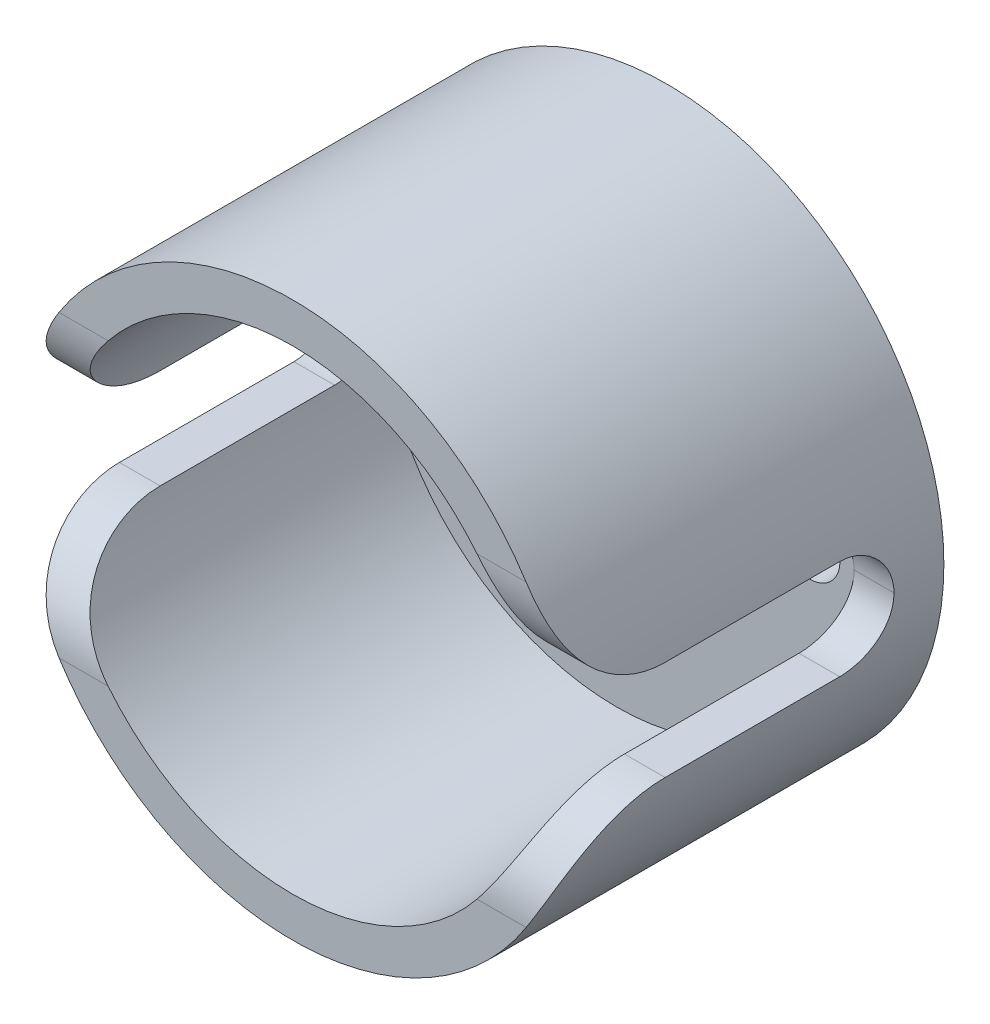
ISO-10303-21;
HEADER;
FILE_DESCRIPTION(('STEP AP214'),'2;1');
FILE_NAME('part.step','',(''),(''),'','','');
FILE_SCHEMA(('AUTOMOTIVE_DESIGN { 1 0 10303 214 1 1 1 1 }'));
ENDSEC;
DATA;
#1=APPLICATION_CONTEXT('core data for automotive mechanical design processes');
#2=APPLICATION_PROTOCOL_DEFINITION('international standard','automotive_design',2000,#1);
#3=PRODUCT_CONTEXT('',#1,'mechanical');
#4=PRODUCT('Part','Part','',(#3));
#5=PRODUCT_RELATED_PRODUCT_CATEGORY('part','',(#4));
#6=PRODUCT_DEFINITION_FORMATION('','',#4);
#7=PRODUCT_DEFINITION_CONTEXT('part definition',#1,'design');
#8=PRODUCT_DEFINITION('design','',#6,#7);
#9=PRODUCT_DEFINITION_SHAPE('','',#8);
#10=(LENGTH_UNIT() NAMED_UNIT(*) SI_UNIT(.MILLI.,.METRE.));
#11=(NAMED_UNIT(*) PLANE_ANGLE_UNIT() SI_UNIT($,.RADIAN.));
#12=(NAMED_UNIT(*) SI_UNIT($,.STERADIAN.) SOLID_ANGLE_UNIT());
#13=UNCERTAINTY_MEASURE_WITH_UNIT(LENGTH_MEASURE(1.E-05),#10,'distance_accuracy_value','');
#14=(GEOMETRIC_REPRESENTATION_CONTEXT(3) GLOBAL_UNCERTAINTY_ASSIGNED_CONTEXT((#13)) GLOBAL_UNIT_ASSIGNED_CONTEXT((#10,
#11,#12)) REPRESENTATION_CONTEXT('',''));
#15=CARTESIAN_POINT('',(0.,0.,0.));
#16=DIRECTION('',(0.,0.,1.));
#17=DIRECTION('',(1.,0.,0.));
#18=AXIS2_PLACEMENT_3D('',#15,#16,#17);
#19=CARTESIAN_POINT('',(0.,0.,15.));
#20=DIRECTION('',(0.,0.,-1.));
#21=DIRECTION('',(-1.,0.,0.));
#22=AXIS2_PLACEMENT_3D('',#19,#20,#21);
#23=CYLINDRICAL_SURFACE('',#22,11.125);
#24=CARTESIAN_POINT('',(0.,0.,0.));
#25=DIRECTION('',(0.,0.,1.));
#26=DIRECTION('',(1.,0.,0.));
#27=AXIS2_PLACEMENT_3D('',#24,#25,#26);
#28=CIRCLE('',#27,11.125);
#29=CARTESIAN_POINT('',(11.125,0.,0.));
#30=VERTEX_POINT('',#29);
#31=EDGE_CURVE('E231',#30,#30,#28,.T.);
#32=ORIENTED_EDGE('',*,*,#31,.T.);
#33=EDGE_LOOP('',(#32));
#34=FACE_BOUND('',#33,.T.);
#35=CARTESIAN_POINT('',(0.,0.,15.));
#36=DIRECTION('',(0.,0.,1.));
#37=DIRECTION('',(1.,0.,0.));
#38=AXIS2_PLACEMENT_3D('',#35,#36,#37);
#39=CIRCLE('',#38,11.125);
#40=CARTESIAN_POINT('',(-9.36833096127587,-6.,15.));
#41=VERTEX_POINT('',#40);
#42=CARTESIAN_POINT('',(9.36833096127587,-6.,15.));
#43=VERTEX_POINT('',#42);
#44=EDGE_CURVE('E238',#41,#43,#39,.T.);
#45=ORIENTED_EDGE('',*,*,#44,.F.);
#46=CARTESIAN_POINT('',(-9.36833096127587,-6.,15.));
#47=CARTESIAN_POINT('',(-9.43554663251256,-5.89508202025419,15.0000085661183));
#48=CARTESIAN_POINT('',(-9.50099180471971,-5.7889844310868,14.9958714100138));
#49=CARTESIAN_POINT('',(-9.62804335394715,-5.57510434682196,14.97881459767));
#50=CARTESIAN_POINT('',(-9.68964674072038,-5.4673206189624,14.9658881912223));
#51=CARTESIAN_POINT('',(-9.80884421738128,-5.25048469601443,14.9306918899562));
#52=CARTESIAN_POINT('',(-9.86642175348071,-5.14142919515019,14.9083857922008));
#53=CARTESIAN_POINT('',(-9.97698763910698,-4.9234405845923,14.8540410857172));
#54=CARTESIAN_POINT('',(-10.0299771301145,-4.81450745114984,14.8220049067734));
#55=CARTESIAN_POINT('',(-10.1314092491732,-4.59724050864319,14.7477343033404));
#56=CARTESIAN_POINT('',(-10.179826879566,-4.48891273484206,14.7054478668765));
#57=CARTESIAN_POINT('',(-10.2716477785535,-4.27463017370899,14.6106539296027));
#58=CARTESIAN_POINT('',(-10.3150514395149,-4.16867520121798,14.5581472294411));
#59=CARTESIAN_POINT('',(-10.3967084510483,-3.96062380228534,14.4431150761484));
#60=CARTESIAN_POINT('',(-10.4349733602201,-3.85851910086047,14.3806128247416));
#61=CARTESIAN_POINT('',(-10.5065319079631,-3.65918381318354,14.2457747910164));
#62=CARTESIAN_POINT('',(-10.5398261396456,-3.56195264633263,14.1734401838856));
#63=CARTESIAN_POINT('',(-10.5985631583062,-3.38290822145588,14.0270204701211));
#64=CARTESIAN_POINT('',(-10.6244567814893,-3.30052112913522,13.9538158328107));
#65=CARTESIAN_POINT('',(-10.6725552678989,-3.14151098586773,13.8002256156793));
#66=CARTESIAN_POINT('',(-10.6947589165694,-3.06488983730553,13.7198376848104));
#67=CARTESIAN_POINT('',(-10.7357126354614,-2.91820209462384,13.5524310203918));
#68=CARTESIAN_POINT('',(-10.7544619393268,-2.84813695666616,13.465410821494));
#69=CARTESIAN_POINT('',(-10.7887761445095,-2.71526064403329,13.2853943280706));
#70=CARTESIAN_POINT('',(-10.8043399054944,-2.65245207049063,13.1923959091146));
#71=CARTESIAN_POINT('',(-10.8456289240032,-2.4802409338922,12.9125745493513));
#72=CARTESIAN_POINT('',(-10.8674492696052,-2.38143302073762,12.7184834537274));
#73=CARTESIAN_POINT('',(-10.9022790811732,-2.21654778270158,12.316333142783));
#74=CARTESIAN_POINT('',(-10.9152941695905,-2.15044957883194,12.108282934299));
#75=CARTESIAN_POINT('',(-10.9311706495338,-2.06792709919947,11.7493505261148));
#76=CARTESIAN_POINT('',(-10.9359237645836,-2.04247758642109,11.6005655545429));
#77=CARTESIAN_POINT('',(-10.9421933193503,-2.00850913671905,11.3012037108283));
#78=CARTESIAN_POINT('',(-10.9437139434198,-1.99996831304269,11.1506294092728));
#79=CARTESIAN_POINT('',(-10.9437482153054,-2.,11.));
#80=B_SPLINE_CURVE_WITH_KNOTS('',3,(#46,#47,#48,#49,#50,#51,#52,#53,#54,#55,#56,#57,#58,#59,#60,
#61,#62,#63,#64,#65,#66,#67,#68,#69,#70,#71,#72,#73,#74,#75,#76,#77,#78,#79),.UNSPECIFIED.,.F.,
.F.,(4,2,2,2,2,2,2,2,2,2,2,2,2,2,2,2,4),(0.,0.373777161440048,0.747841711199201,
1.12336349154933,1.49879157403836,1.87616607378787,2.25351102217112,2.62999246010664,
3.00642893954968,3.34563995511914,3.68496240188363,4.02436003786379,4.36387895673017,
5.01722593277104,5.67015533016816,6.12227256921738,6.57380420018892),.UNSPECIFIED.);
#81=CARTESIAN_POINT('',(-10.9437482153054,-2.,11.));
#82=VERTEX_POINT('',#81);
#83=EDGE_CURVE('E200',#41,#82,#80,.T.);
#84=ORIENTED_EDGE('',*,*,#83,.T.);
#85=DIRECTION('',(0.,0.,-1.));
#86=VECTOR('',#85,1.);
#87=CARTESIAN_POINT('',(-10.9437482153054,-2.,15.));
#88=LINE('',#87,#86);
#89=CARTESIAN_POINT('',(-10.9437482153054,-2.,4.));
#90=VERTEX_POINT('',#89);
#91=EDGE_CURVE('E191',#90,#82,#88,.F.);
#92=ORIENTED_EDGE('',*,*,#91,.F.);
#93=CARTESIAN_POINT('',(-10.9437482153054,-2.,4.));
#94=CARTESIAN_POINT('',(-10.9437456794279,-2.00000016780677,3.94421527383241));
#95=CARTESIAN_POINT('',(-10.9441752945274,-1.9976645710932,3.8884577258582));
#96=CARTESIAN_POINT('',(-10.9458723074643,-1.98835048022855,3.77735069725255));
#97=CARTESIAN_POINT('',(-10.9471396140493,-1.98137249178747,3.72200117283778));
#98=CARTESIAN_POINT('',(-10.9521507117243,-1.95356003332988,3.55733095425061));
#99=CARTESIAN_POINT('',(-10.9571039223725,-1.92584675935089,3.44912755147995));
#100=CARTESIAN_POINT('',(-10.9696718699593,-1.85291009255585,3.23900482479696));
#101=CARTESIAN_POINT('',(-10.9772871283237,-1.80768326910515,3.13708673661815));
#102=CARTESIAN_POINT('',(-10.9943175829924,-1.7010325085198,2.94225879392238));
#103=CARTESIAN_POINT('',(-11.0037329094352,-1.63960740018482,2.84934959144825));
#104=CARTESIAN_POINT('',(-11.0234209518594,-1.50156960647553,2.67415927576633));
#105=CARTESIAN_POINT('',(-11.0337013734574,-1.42480965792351,2.59199510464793));
#106=CARTESIAN_POINT('',(-11.053894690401,-1.25858373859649,2.44162665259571));
#107=CARTESIAN_POINT('',(-11.06380751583,-1.16911536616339,2.37342501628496));
#108=CARTESIAN_POINT('',(-11.0822325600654,-0.979234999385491,2.25246896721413));
#109=CARTESIAN_POINT('',(-11.0907341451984,-0.878748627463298,2.19982968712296));
#110=CARTESIAN_POINT('',(-11.1052845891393,-0.67020341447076,2.11225117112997));
#111=CARTESIAN_POINT('',(-11.1113351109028,-0.562149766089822,2.07729993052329));
#112=CARTESIAN_POINT('',(-11.1188272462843,-0.377895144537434,2.03455321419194));
#113=CARTESIAN_POINT('',(-11.1211298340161,-0.302883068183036,2.02160957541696));
#114=CARTESIAN_POINT('',(-11.1242213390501,-0.151925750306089,2.00433092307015));
#115=CARTESIAN_POINT('',(-11.125011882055,-0.0759815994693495,1.9999866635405));
#116=CARTESIAN_POINT('',(-11.125,0.,2.));
#117=B_SPLINE_CURVE_WITH_KNOTS('',3,(#93,#94,#95,#96,#97,#98,#99,#100,#101,#102,#103,#104,#105,
#106,#107,#108,#109,#110,#111,#112,#113,#114,#115,#116),.UNSPECIFIED.,.F.,.F.,(4,2,2,2,2,2,2,2,
2,2,2,4),(0.,0.167249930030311,0.334481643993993,0.668171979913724,1.00192771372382,
1.33570758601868,1.67286185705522,2.0100799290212,2.34973371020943,2.68915666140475,
2.91714695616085,3.14489198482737),.UNSPECIFIED.);
#118=CARTESIAN_POINT('',(-11.125,0.,2.));
#119=VERTEX_POINT('',#118);
#120=EDGE_CURVE('E173',#90,#119,#117,.T.);
#121=ORIENTED_EDGE('',*,*,#120,.T.);
#122=CARTESIAN_POINT('',(-11.125,0.,2.));
#123=CARTESIAN_POINT('',(-11.1250023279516,0.0557921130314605,1.9999998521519));
#124=CARTESIAN_POINT('',(-11.1245797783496,0.111557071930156,2.00233604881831));
#125=CARTESIAN_POINT('',(-11.1229096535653,0.222679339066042,2.01165265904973));
#126=CARTESIAN_POINT('',(-11.1216621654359,0.278036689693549,2.01863258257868));
#127=CARTESIAN_POINT('',(-11.1167267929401,0.442733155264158,2.04645342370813));
#128=CARTESIAN_POINT('',(-11.1118457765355,0.550955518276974,2.07417571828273));
#129=CARTESIAN_POINT('',(-11.0994343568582,0.761117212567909,2.14713864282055));
#130=CARTESIAN_POINT('',(-11.091903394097,0.863055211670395,2.19238297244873));
#131=CARTESIAN_POINT('',(-11.0750172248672,1.05791598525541,2.29907464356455));
#132=CARTESIAN_POINT('',(-11.0656619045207,1.15083819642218,2.36052299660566));
#133=CARTESIAN_POINT('',(-11.0460478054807,1.32601358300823,2.49858437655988));
#134=CARTESIAN_POINT('',(-11.035781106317,1.40815388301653,2.57533943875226));
#135=CARTESIAN_POINT('',(-11.0155591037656,1.55847635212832,2.74154575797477));
#136=CARTESIAN_POINT('',(-11.0056038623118,1.62665575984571,2.83099952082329));
#137=CARTESIAN_POINT('',(-10.9870535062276,1.74758819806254,3.02086676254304));
#138=CARTESIAN_POINT('',(-10.9784691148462,1.80022210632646,3.12135716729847));
#139=CARTESIAN_POINT('',(-10.9637520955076,1.88778932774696,3.32991054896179));
#140=CARTESIAN_POINT('',(-10.9576177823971,1.92273481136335,3.43796826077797));
#141=CARTESIAN_POINT('',(-10.95001716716,1.96546553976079,3.62220705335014));
#142=CARTESIAN_POINT('',(-10.9476793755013,1.97840197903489,3.69719790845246));
#143=CARTESIAN_POINT('',(-10.9445393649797,1.99567133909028,3.84811401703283));
#144=CARTESIAN_POINT('',(-10.9437355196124,2.00001337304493,3.92403819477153));
#145=CARTESIAN_POINT('',(-10.9437482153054,2.,4.));
#146=B_SPLINE_CURVE_WITH_KNOTS('',3,(#122,#123,#124,#125,#126,#127,#128,#129,#130,#131,#132,
#133,#134,#135,#136,#137,#138,#139,#140,#141,#142,#143,#144,#145),.UNSPECIFIED.,.F.,.F.,(4,2,2,
2,2,2,2,2,2,2,2,4),(0.,0.167272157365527,0.334526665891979,0.668269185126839,1.00208221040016,
1.33591607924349,1.67300533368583,2.01016119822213,2.34983731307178,2.68927939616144,
2.91720652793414,3.14489184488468),.UNSPECIFIED.);
#147=CARTESIAN_POINT('',(-10.9437482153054,2.,4.));
#148=VERTEX_POINT('',#147);
#149=EDGE_CURVE('E270',#119,#148,#146,.T.);
#150=ORIENTED_EDGE('',*,*,#149,.T.);
#151=DIRECTION('',(0.,0.,-1.));
#152=VECTOR('',#151,1.);
#153=CARTESIAN_POINT('',(-10.9437482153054,2.,15.));
#154=LINE('',#153,#152);
#155=CARTESIAN_POINT('',(-10.9437482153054,2.,11.));
#156=VERTEX_POINT('',#155);
#157=EDGE_CURVE('E224',#156,#148,#154,.T.);
#158=ORIENTED_EDGE('',*,*,#157,.F.);
#159=CARTESIAN_POINT('',(-10.9437482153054,2.,11.));
#160=CARTESIAN_POINT('',(-10.9437380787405,1.99998723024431,11.1102300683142));
#161=CARTESIAN_POINT('',(-10.942915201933,2.00455596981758,11.2204590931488));
#162=CARTESIAN_POINT('',(-10.9395706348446,2.02276492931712,11.4401375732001));
#163=CARTESIAN_POINT('',(-10.9370489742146,2.03640499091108,11.5495870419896));
#164=CARTESIAN_POINT('',(-10.930235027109,2.07265699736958,11.7668844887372));
#165=CARTESIAN_POINT('',(-10.925943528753,2.09526494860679,11.8747331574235));
#166=CARTESIAN_POINT('',(-10.9154489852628,2.14926954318,12.0881103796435));
#167=CARTESIAN_POINT('',(-10.9092459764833,2.18066601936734,12.1936389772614));
#168=CARTESIAN_POINT('',(-10.8947410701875,2.25201362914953,12.4016765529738));
#169=CARTESIAN_POINT('',(-10.8864380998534,2.29196913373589,12.5041839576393));
#170=CARTESIAN_POINT('',(-10.8675082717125,2.38010933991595,12.7054213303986));
#171=CARTESIAN_POINT('',(-10.8568805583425,2.42829706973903,12.8041498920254));
#172=CARTESIAN_POINT('',(-10.83306026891,2.53244550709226,12.9970150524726));
#173=CARTESIAN_POINT('',(-10.8198692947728,2.58840135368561,13.0911544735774));
#174=CARTESIAN_POINT('',(-10.790649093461,2.70763442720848,13.2742623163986));
#175=CARTESIAN_POINT('',(-10.7746188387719,2.77091430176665,13.363228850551));
#176=CARTESIAN_POINT('',(-10.7395837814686,2.90372981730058,13.5347170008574));
#177=CARTESIAN_POINT('',(-10.7206006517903,2.97321842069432,13.6172794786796));
#178=CARTESIAN_POINT('',(-10.6793307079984,3.11820487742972,13.776116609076));
#179=CARTESIAN_POINT('',(-10.6570426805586,3.19370493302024,13.8523889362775));
#180=CARTESIAN_POINT('',(-10.6089772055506,3.34991014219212,13.9980694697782));
#181=CARTESIAN_POINT('',(-10.5832025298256,3.43061113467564,14.0674830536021));
#182=CARTESIAN_POINT('',(-10.527976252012,3.59652415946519,14.1991441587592));
#183=CARTESIAN_POINT('',(-10.4985233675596,3.68173775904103,14.2613891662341));
#184=CARTESIAN_POINT('',(-10.4359644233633,3.85548461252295,14.3781602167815));
#185=CARTESIAN_POINT('',(-10.4028733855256,3.94400328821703,14.4327160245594));
#186=CARTESIAN_POINT('',(-10.3328829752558,4.12389037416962,14.5342445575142));
#187=CARTESIAN_POINT('',(-10.2959819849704,4.21525998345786,14.5812140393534));
#188=CARTESIAN_POINT('',(-10.2183600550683,4.40009089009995,14.667520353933));
#189=CARTESIAN_POINT('',(-10.1776350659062,4.49355432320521,14.7068489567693));
#190=CARTESIAN_POINT('',(-10.0924748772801,4.68169188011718,14.7778531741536));
#191=CARTESIAN_POINT('',(-10.048039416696,4.77636608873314,14.8095282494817));
#192=CARTESIAN_POINT('',(-9.95557465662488,4.96621693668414,14.8653703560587));
#193=CARTESIAN_POINT('',(-9.90754386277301,5.06139376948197,14.889534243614));
#194=CARTESIAN_POINT('',(-9.80807475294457,5.2515535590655,14.9305586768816));
#195=CARTESIAN_POINT('',(-9.75663588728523,5.34653648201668,14.9474180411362));
#196=CARTESIAN_POINT('',(-9.65072307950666,5.5354172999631,14.9740699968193));
#197=CARTESIAN_POINT('',(-9.59625842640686,5.62931755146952,14.9838830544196));
#198=CARTESIAN_POINT('',(-9.48442168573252,5.81577512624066,14.9968486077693));
#199=CARTESIAN_POINT('',(-9.42705112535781,5.9083331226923,15.0000045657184));
#200=CARTESIAN_POINT('',(-9.36833096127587,6.,15.));
#201=B_SPLINE_CURVE_WITH_KNOTS('',3,(#159,#160,#161,#162,#163,#164,#165,#166,#167,#168,#169,
#170,#171,#172,#173,#174,#175,#176,#177,#178,#179,#180,#181,#182,#183,#184,#185,#186,#187,#188,
#189,#190,#191,#192,#193,#194,#195,#196,#197,#198,#199,#200),.UNSPECIFIED.,.F.,.F.,(4,2,2,2,2,2,
2,2,2,2,2,2,2,2,2,2,2,2,2,2,4),(0.,0.33059115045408,0.661176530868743,0.991614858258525,
1.32204690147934,1.65264809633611,1.9833711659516,2.31388820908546,2.64452510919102,
2.97284076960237,3.30127726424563,3.62945417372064,3.95774581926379,4.28472953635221,
4.61185267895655,4.93932623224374,5.26682285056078,5.59445635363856,5.92214282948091,
6.24887363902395,6.57543448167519),.UNSPECIFIED.);
#202=CARTESIAN_POINT('',(-9.36833096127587,6.,15.));
#203=VERTEX_POINT('',#202);
#204=EDGE_CURVE('E356',#156,#203,#201,.T.);
#205=ORIENTED_EDGE('',*,*,#204,.T.);
#206=CARTESIAN_POINT('',(9.36833096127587,6.,15.));
#207=VERTEX_POINT('',#206);
#208=EDGE_CURVE('E197',#207,#203,#39,.T.);
#209=ORIENTED_EDGE('',*,*,#208,.F.);
#210=CARTESIAN_POINT('',(9.36833096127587,6.,15.));
#211=CARTESIAN_POINT('',(9.43554663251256,5.89508202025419,15.0000085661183));
#212=CARTESIAN_POINT('',(9.50099180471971,5.78898443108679,14.9958714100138));
#213=CARTESIAN_POINT('',(9.62804335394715,5.57510434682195,14.97881459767));
#214=CARTESIAN_POINT('',(9.68964674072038,5.46732061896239,14.9658881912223));
#215=CARTESIAN_POINT('',(9.80884421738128,5.25048469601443,14.9306918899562));
#216=CARTESIAN_POINT('',(9.86642175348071,5.14142919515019,14.9083857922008));
#217=CARTESIAN_POINT('',(9.97698763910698,4.9234405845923,14.8540410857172));
#218=CARTESIAN_POINT('',(10.0299771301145,4.81450745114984,14.8220049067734));
#219=CARTESIAN_POINT('',(10.1314092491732,4.59724050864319,14.7477343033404));
#220=CARTESIAN_POINT('',(10.179826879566,4.48891273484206,14.7054478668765));
#221=CARTESIAN_POINT('',(10.2716477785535,4.27463017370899,14.6106539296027));
#222=CARTESIAN_POINT('',(10.3150514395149,4.16867520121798,14.5581472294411));
#223=CARTESIAN_POINT('',(10.3967084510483,3.96062380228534,14.4431150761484));
#224=CARTESIAN_POINT('',(10.4349733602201,3.85851910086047,14.3806128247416));
#225=CARTESIAN_POINT('',(10.5065319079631,3.65918381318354,14.2457747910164));
#226=CARTESIAN_POINT('',(10.5398261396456,3.56195264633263,14.1734401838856));
#227=CARTESIAN_POINT('',(10.5985631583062,3.38290822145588,14.0270204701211));
#228=CARTESIAN_POINT('',(10.6244567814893,3.30052112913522,13.9538158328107));
#229=CARTESIAN_POINT('',(10.6725552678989,3.14151098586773,13.8002256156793));
#230=CARTESIAN_POINT('',(10.6947589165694,3.06488983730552,13.7198376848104));
#231=CARTESIAN_POINT('',(10.7357126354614,2.91820209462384,13.5524310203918));
#232=CARTESIAN_POINT('',(10.7544619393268,2.84813695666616,13.465410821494));
#233=CARTESIAN_POINT('',(10.7887761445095,2.71526064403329,13.2853943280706));
#234=CARTESIAN_POINT('',(10.8043399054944,2.65245207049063,13.1923959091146));
#235=CARTESIAN_POINT('',(10.8456289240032,2.4802409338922,12.9125745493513));
#236=CARTESIAN_POINT('',(10.8674492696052,2.38143302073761,12.7184834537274));
#237=CARTESIAN_POINT('',(10.9022790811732,2.21654778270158,12.316333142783));
#238=CARTESIAN_POINT('',(10.9152941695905,2.15044957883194,12.108282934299));
#239=CARTESIAN_POINT('',(10.9311706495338,2.06792709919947,11.7493505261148));
#240=CARTESIAN_POINT('',(10.9359237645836,2.04247758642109,11.6005655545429));
#241=CARTESIAN_POINT('',(10.9421933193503,2.00850913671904,11.3012037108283));
#242=CARTESIAN_POINT('',(10.9437139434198,1.99996831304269,11.1506294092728));
#243=CARTESIAN_POINT('',(10.9437482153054,2.,11.));
#244=B_SPLINE_CURVE_WITH_KNOTS('',3,(#210,#211,#212,#213,#214,#215,#216,#217,#218,#219,#220,
#221,#222,#223,#224,#225,#226,#227,#228,#229,#230,#231,#232,#233,#234,#235,#236,#237,#238,#239,
#240,#241,#242,#243),.UNSPECIFIED.,.F.,.F.,(4,2,2,2,2,2,2,2,2,2,2,2,2,2,2,2,4),(0.,
0.373777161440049,0.747841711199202,1.12336349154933,1.49879157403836,1.87616607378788,
2.25351102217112,2.62999246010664,3.00642893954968,3.34563995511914,3.68496240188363,
4.02436003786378,4.36387895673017,5.01722593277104,5.67015533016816,6.12227256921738,
6.57380420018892),.UNSPECIFIED.);
#245=CARTESIAN_POINT('',(10.9437482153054,2.,11.));
#246=VERTEX_POINT('',#245);
#247=EDGE_CURVE('E349',#207,#246,#244,.T.);
#248=ORIENTED_EDGE('',*,*,#247,.T.);
#249=DIRECTION('',(0.,0.,-1.));
#250=VECTOR('',#249,1.);
#251=CARTESIAN_POINT('',(10.9437482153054,2.,15.));
#252=LINE('',#251,#250);
#253=CARTESIAN_POINT('',(10.9437482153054,2.,4.));
#254=VERTEX_POINT('',#253);
#255=EDGE_CURVE('E220',#254,#246,#252,.F.);
#256=ORIENTED_EDGE('',*,*,#255,.F.);
#257=CARTESIAN_POINT('',(10.9437482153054,2.,4.));
#258=CARTESIAN_POINT('',(10.9437456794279,2.00000016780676,3.94421527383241));
#259=CARTESIAN_POINT('',(10.9441752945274,1.9976645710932,3.8884577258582));
#260=CARTESIAN_POINT('',(10.9458723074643,1.98835048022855,3.77735069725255));
#261=CARTESIAN_POINT('',(10.9471396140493,1.98137249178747,3.72200117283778));
#262=CARTESIAN_POINT('',(10.9521507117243,1.95356003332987,3.55733095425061));
#263=CARTESIAN_POINT('',(10.9571039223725,1.92584675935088,3.44912755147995));
#264=CARTESIAN_POINT('',(10.9696718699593,1.85291009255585,3.23900482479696));
#265=CARTESIAN_POINT('',(10.9772871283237,1.80768326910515,3.13708673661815));
#266=CARTESIAN_POINT('',(10.9943175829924,1.70103250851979,2.94225879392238));
#267=CARTESIAN_POINT('',(11.0037329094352,1.63960740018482,2.84934959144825));
#268=CARTESIAN_POINT('',(11.0234209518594,1.50156960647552,2.67415927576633));
#269=CARTESIAN_POINT('',(11.0337013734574,1.4248096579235,2.59199510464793));
#270=CARTESIAN_POINT('',(11.053894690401,1.25858373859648,2.44162665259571));
#271=CARTESIAN_POINT('',(11.06380751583,1.16911536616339,2.37342501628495));
#272=CARTESIAN_POINT('',(11.0822325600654,0.979234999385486,2.25246896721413));
#273=CARTESIAN_POINT('',(11.0907341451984,0.878748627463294,2.19982968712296));
#274=CARTESIAN_POINT('',(11.1052845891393,0.670203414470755,2.11225117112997));
#275=CARTESIAN_POINT('',(11.1113351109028,0.562149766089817,2.07729993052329));
#276=CARTESIAN_POINT('',(11.1188272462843,0.37789514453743,2.03455321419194));
#277=CARTESIAN_POINT('',(11.1211298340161,0.302883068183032,2.02160957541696));
#278=CARTESIAN_POINT('',(11.1242213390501,0.151925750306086,2.00433092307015));
#279=CARTESIAN_POINT('',(11.125011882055,0.0759815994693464,1.9999866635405));
#280=CARTESIAN_POINT('',(11.125,0.,2.));
#281=B_SPLINE_CURVE_WITH_KNOTS('',3,(#257,#258,#259,#260,#261,#262,#263,#264,#265,#266,#267,
#268,#269,#270,#271,#272,#273,#274,#275,#276,#277,#278,#279,#280),.UNSPECIFIED.,.F.,.F.,(4,2,2,
2,2,2,2,2,2,2,2,4),(0.,0.167249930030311,0.334481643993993,0.668171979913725,1.00192771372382,
1.33570758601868,1.67286185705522,2.0100799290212,2.34973371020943,2.68915666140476,
2.91714695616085,3.14489198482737),.UNSPECIFIED.);
#282=CARTESIAN_POINT('',(11.125,0.,2.));
#283=VERTEX_POINT('',#282);
#284=EDGE_CURVE('E470',#254,#283,#281,.T.);
#285=ORIENTED_EDGE('',*,*,#284,.T.);
#286=CARTESIAN_POINT('',(11.125,0.,2.));
#287=CARTESIAN_POINT('',(11.1250023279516,-0.0557921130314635,1.9999998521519));
#288=CARTESIAN_POINT('',(11.1245797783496,-0.111557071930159,2.00233604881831));
#289=CARTESIAN_POINT('',(11.1229096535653,-0.222679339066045,2.01165265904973));
#290=CARTESIAN_POINT('',(11.1216621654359,-0.278036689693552,2.01863258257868));
#291=CARTESIAN_POINT('',(11.1167267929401,-0.442733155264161,2.04645342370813));
#292=CARTESIAN_POINT('',(11.1118457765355,-0.550955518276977,2.07417571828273));
#293=CARTESIAN_POINT('',(11.0994343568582,-0.761117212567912,2.14713864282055));
#294=CARTESIAN_POINT('',(11.091903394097,-0.863055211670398,2.19238297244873));
#295=CARTESIAN_POINT('',(11.0750172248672,-1.05791598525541,2.29907464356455));
#296=CARTESIAN_POINT('',(11.0656619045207,-1.15083819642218,2.36052299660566));
#297=CARTESIAN_POINT('',(11.0460478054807,-1.32601358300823,2.49858437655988));
#298=CARTESIAN_POINT('',(11.035781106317,-1.40815388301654,2.57533943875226));
#299=CARTESIAN_POINT('',(11.0155591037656,-1.55847635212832,2.74154575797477));
#300=CARTESIAN_POINT('',(11.0056038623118,-1.62665575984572,2.83099952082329));
#301=CARTESIAN_POINT('',(10.9870535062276,-1.74758819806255,3.02086676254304));
#302=CARTESIAN_POINT('',(10.9784691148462,-1.80022210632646,3.12135716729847));
#303=CARTESIAN_POINT('',(10.9637520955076,-1.88778932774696,3.32991054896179));
#304=CARTESIAN_POINT('',(10.9576177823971,-1.92273481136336,3.43796826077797));
#305=CARTESIAN_POINT('',(10.95001716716,-1.9654655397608,3.62220705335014));
#306=CARTESIAN_POINT('',(10.9476793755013,-1.9784019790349,3.69719790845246));
#307=CARTESIAN_POINT('',(10.9445393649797,-1.99567133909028,3.84811401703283));
#308=CARTESIAN_POINT('',(10.9437355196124,-2.00001337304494,3.92403819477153));
#309=CARTESIAN_POINT('',(10.9437482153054,-2.,4.));
#310=B_SPLINE_CURVE_WITH_KNOTS('',3,(#286,#287,#288,#289,#290,#291,#292,#293,#294,#295,#296,
#297,#298,#299,#300,#301,#302,#303,#304,#305,#306,#307,#308,#309),.UNSPECIFIED.,.F.,.F.,(4,2,2,
2,2,2,2,2,2,2,2,4),(0.,0.167272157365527,0.334526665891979,0.668269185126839,1.00208221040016,
1.33591607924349,1.67300533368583,2.01016119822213,2.34983731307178,2.68927939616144,
2.91720652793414,3.14489184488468),.UNSPECIFIED.);
#311=CARTESIAN_POINT('',(10.9437482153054,-2.,4.));
#312=VERTEX_POINT('',#311);
#313=EDGE_CURVE('E381',#283,#312,#310,.T.);
#314=ORIENTED_EDGE('',*,*,#313,.T.);
#315=DIRECTION('',(0.,0.,-1.));
#316=VECTOR('',#315,1.);
#317=CARTESIAN_POINT('',(10.9437482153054,-2.,15.));
#318=LINE('',#317,#316);
#319=CARTESIAN_POINT('',(10.9437482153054,-2.,11.));
#320=VERTEX_POINT('',#319);
#321=EDGE_CURVE('E202',#320,#312,#318,.T.);
#322=ORIENTED_EDGE('',*,*,#321,.F.);
#323=CARTESIAN_POINT('',(10.9437482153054,-2.,11.));
#324=CARTESIAN_POINT('',(10.9437380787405,-1.99998723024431,11.1102300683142));
#325=CARTESIAN_POINT('',(10.942915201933,-2.00455596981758,11.2204590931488));
#326=CARTESIAN_POINT('',(10.9395706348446,-2.02276492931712,11.4401375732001));
#327=CARTESIAN_POINT('',(10.9370489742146,-2.03640499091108,11.5495870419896));
#328=CARTESIAN_POINT('',(10.930235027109,-2.07265699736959,11.7668844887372));
#329=CARTESIAN_POINT('',(10.925943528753,-2.09526494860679,11.8747331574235));
#330=CARTESIAN_POINT('',(10.9154489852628,-2.14926954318,12.0881103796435));
#331=CARTESIAN_POINT('',(10.9092459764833,-2.18066601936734,12.1936389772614));
#332=CARTESIAN_POINT('',(10.8947410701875,-2.25201362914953,12.4016765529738));
#333=CARTESIAN_POINT('',(10.8864380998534,-2.29196913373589,12.5041839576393));
#334=CARTESIAN_POINT('',(10.8675082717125,-2.38010933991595,12.7054213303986));
#335=CARTESIAN_POINT('',(10.8568805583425,-2.42829706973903,12.8041498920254));
#336=CARTESIAN_POINT('',(10.83306026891,-2.53244550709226,12.9970150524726));
#337=CARTESIAN_POINT('',(10.8198692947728,-2.58840135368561,13.0911544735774));
#338=CARTESIAN_POINT('',(10.790649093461,-2.70763442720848,13.2742623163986));
#339=CARTESIAN_POINT('',(10.7746188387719,-2.77091430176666,13.363228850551));
#340=CARTESIAN_POINT('',(10.7395837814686,-2.90372981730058,13.5347170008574));
#341=CARTESIAN_POINT('',(10.7206006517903,-2.97321842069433,13.6172794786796));
#342=CARTESIAN_POINT('',(10.6793307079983,-3.11820487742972,13.776116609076));
#343=CARTESIAN_POINT('',(10.6570426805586,-3.19370493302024,13.8523889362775));
#344=CARTESIAN_POINT('',(10.6089772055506,-3.34991014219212,13.9980694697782));
#345=CARTESIAN_POINT('',(10.5832025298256,-3.43061113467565,14.0674830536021));
#346=CARTESIAN_POINT('',(10.527976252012,-3.5965241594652,14.1991441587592));
#347=CARTESIAN_POINT('',(10.4985233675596,-3.68173775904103,14.2613891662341));
#348=CARTESIAN_POINT('',(10.4359644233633,-3.85548461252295,14.3781602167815));
#349=CARTESIAN_POINT('',(10.4028733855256,-3.94400328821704,14.4327160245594));
#350=CARTESIAN_POINT('',(10.3328829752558,-4.12389037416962,14.5342445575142));
#351=CARTESIAN_POINT('',(10.2959819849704,-4.21525998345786,14.5812140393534));
#352=CARTESIAN_POINT('',(10.2183600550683,-4.40009089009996,14.667520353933));
#353=CARTESIAN_POINT('',(10.1776350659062,-4.49355432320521,14.7068489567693));
#354=CARTESIAN_POINT('',(10.0924748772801,-4.68169188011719,14.7778531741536));
#355=CARTESIAN_POINT('',(10.048039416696,-4.77636608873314,14.8095282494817));
#356=CARTESIAN_POINT('',(9.95557465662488,-4.96621693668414,14.8653703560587));
#357=CARTESIAN_POINT('',(9.90754386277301,-5.06139376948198,14.889534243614));
#358=CARTESIAN_POINT('',(9.80807475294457,-5.2515535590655,14.9305586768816));
#359=CARTESIAN_POINT('',(9.75663588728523,-5.34653648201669,14.9474180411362));
#360=CARTESIAN_POINT('',(9.65072307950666,-5.5354172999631,14.9740699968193));
#361=CARTESIAN_POINT('',(9.59625842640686,-5.62931755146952,14.9838830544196));
#362=CARTESIAN_POINT('',(9.48442168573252,-5.81577512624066,14.9968486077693));
#363=CARTESIAN_POINT('',(9.42705112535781,-5.9083331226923,15.0000045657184));
#364=CARTESIAN_POINT('',(9.36833096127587,-6.,15.));
#365=B_SPLINE_CURVE_WITH_KNOTS('',3,(#323,#324,#325,#326,#327,#328,#329,#330,#331,#332,#333,
#334,#335,#336,#337,#338,#339,#340,#341,#342,#343,#344,#345,#346,#347,#348,#349,#350,#351,#352,
#353,#354,#355,#356,#357,#358,#359,#360,#361,#362,#363,#364),.UNSPECIFIED.,.F.,.F.,(4,2,2,2,2,2,
2,2,2,2,2,2,2,2,2,2,2,2,2,2,4),(0.,0.33059115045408,0.661176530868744,0.991614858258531,
1.32204690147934,1.65264809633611,1.9833711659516,2.31388820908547,2.64452510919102,
2.97284076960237,3.30127726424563,3.62945417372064,3.95774581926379,4.28472953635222,
4.61185267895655,4.93932623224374,5.26682285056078,5.59445635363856,5.92214282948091,
6.24887363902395,6.5754344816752),.UNSPECIFIED.);
#366=EDGE_CURVE('E357',#320,#43,#365,.T.);
#367=ORIENTED_EDGE('',*,*,#366,.T.);
#368=EDGE_LOOP('',(#45,#84,#92,#121,#150,#158,#205,#209,#248,#256,#285,#314,#322,#367));
#369=FACE_BOUND('',#368,.T.);
#370=ADVANCED_FACE('F38',(#34,#369),#23,.T.);
#371=CARTESIAN_POINT('',(0.,0.,15.));
#372=DIRECTION('',(0.,0.,1.));
#373=DIRECTION('',(1.,0.,0.));
#374=AXIS2_PLACEMENT_3D('',#371,#372,#373);
#375=PLANE('',#374);
#376=ORIENTED_EDGE('',*,*,#208,.T.);
#377=DIRECTION('',(-1.,0.,0.));
#378=VECTOR('',#377,1.);
#379=CARTESIAN_POINT('',(0.,6.,15.));
#380=LINE('',#379,#378);
#381=CARTESIAN_POINT('',(-7.39767700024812,6.,15.));
#382=VERTEX_POINT('',#381);
#383=EDGE_CURVE('E70',#203,#382,#380,.F.);
#384=ORIENTED_EDGE('',*,*,#383,.T.);
#385=CARTESIAN_POINT('',(0.,0.,15.));
#386=DIRECTION('',(0.,0.,1.));
#387=DIRECTION('',(1.,0.,0.));
#388=AXIS2_PLACEMENT_3D('',#385,#386,#387);
#389=CIRCLE('',#388,9.525);
#390=CARTESIAN_POINT('',(7.39767700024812,6.,15.));
#391=VERTEX_POINT('',#390);
#392=EDGE_CURVE('E233',#391,#382,#389,.T.);
#393=ORIENTED_EDGE('',*,*,#392,.F.);
#394=DIRECTION('',(-1.,0.,0.));
#395=VECTOR('',#394,1.);
#396=CARTESIAN_POINT('',(0.,6.,15.));
#397=LINE('',#396,#395);
#398=EDGE_CURVE('E487',#391,#207,#397,.F.);
#399=ORIENTED_EDGE('',*,*,#398,.T.);
#400=EDGE_LOOP('',(#376,#384,#393,#399));
#401=FACE_BOUND('',#400,.T.);
#402=ADVANCED_FACE('F294',(#401),#375,.T.);
#403=CARTESIAN_POINT('',(-7.39767700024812,-6.,15.));
#404=VERTEX_POINT('',#403);
#405=CARTESIAN_POINT('',(7.39767700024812,-6.,15.));
#406=VERTEX_POINT('',#405);
#407=EDGE_CURVE('E227',#404,#406,#389,.T.);
#408=ORIENTED_EDGE('',*,*,#407,.F.);
#409=DIRECTION('',(-1.,0.,0.));
#410=VECTOR('',#409,1.);
#411=CARTESIAN_POINT('',(0.,-6.,15.));
#412=LINE('',#411,#410);
#413=EDGE_CURVE('E396',#404,#41,#412,.T.);
#414=ORIENTED_EDGE('',*,*,#413,.T.);
#415=ORIENTED_EDGE('',*,*,#44,.T.);
#416=DIRECTION('',(-1.,0.,0.));
#417=VECTOR('',#416,1.);
#418=CARTESIAN_POINT('',(0.,-6.,15.));
#419=LINE('',#418,#417);
#420=EDGE_CURVE('E388',#43,#406,#419,.T.);
#421=ORIENTED_EDGE('',*,*,#420,.T.);
#422=EDGE_LOOP('',(#408,#414,#415,#421));
#423=FACE_BOUND('',#422,.T.);
#424=ADVANCED_FACE('F290',(#423),#375,.T.);
#425=CARTESIAN_POINT('',(0.,0.,2.));
#426=DIRECTION('',(0.,0.,1.));
#427=DIRECTION('',(1.,0.,0.));
#428=AXIS2_PLACEMENT_3D('',#425,#426,#427);
#429=CYLINDRICAL_SURFACE('',#428,9.525);
#430=ORIENTED_EDGE('',*,*,#392,.T.);
#431=CARTESIAN_POINT('',(-7.39767700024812,6.,15.));
#432=CARTESIAN_POINT('',(-7.47959102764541,5.89903587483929,15.0000059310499));
#433=CARTESIAN_POINT('',(-7.55943933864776,5.79633074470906,14.996176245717));
#434=CARTESIAN_POINT('',(-7.71465338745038,5.58807047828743,14.9801034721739));
#435=CARTESIAN_POINT('',(-7.79001440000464,5.48251250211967,14.9678516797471));
#436=CARTESIAN_POINT('',(-7.93616305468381,5.26875921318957,14.9340897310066));
#437=CARTESIAN_POINT('',(-8.00692095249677,5.16055197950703,14.9125251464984));
#438=CARTESIAN_POINT('',(-8.14293266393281,4.94314675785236,14.8594785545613));
#439=CARTESIAN_POINT('',(-8.20818826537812,4.8339491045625,14.8279997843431));
#440=CARTESIAN_POINT('',(-8.33330410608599,4.61494135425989,14.7543376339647));
#441=CARTESIAN_POINT('',(-8.39312302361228,4.50513237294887,14.7120802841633));
#442=CARTESIAN_POINT('',(-8.50656798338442,4.28707689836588,14.6166357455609));
#443=CARTESIAN_POINT('',(-8.5601947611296,4.17883022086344,14.5634498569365));
#444=CARTESIAN_POINT('',(-8.66096187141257,3.9657547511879,14.4462416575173));
#445=CARTESIAN_POINT('',(-8.70812298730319,3.86091587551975,14.3822556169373));
#446=CARTESIAN_POINT('',(-8.79618122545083,3.65585431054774,14.2435009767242));
#447=CARTESIAN_POINT('',(-8.83707946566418,3.55563079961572,14.1687343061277));
#448=CARTESIAN_POINT('',(-8.90761893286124,3.37462018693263,14.0197985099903));
#449=CARTESIAN_POINT('',(-8.93803473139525,3.29304886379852,13.9469445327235));
#450=CARTESIAN_POINT('',(-8.99454184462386,3.13541886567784,13.7939637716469));
#451=CARTESIAN_POINT('',(-9.02063352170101,3.05935972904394,13.7138375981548));
#452=CARTESIAN_POINT('',(-9.06877783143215,2.91355387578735,13.5467925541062));
#453=CARTESIAN_POINT('',(-9.09082727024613,2.84381217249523,13.4598683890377));
#454=CARTESIAN_POINT('',(-9.13117334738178,2.71147301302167,13.2799260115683));
#455=CARTESIAN_POINT('',(-9.14947006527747,2.6488754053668,13.1869079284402));
#456=CARTESIAN_POINT('',(-9.18179913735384,2.53447089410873,13.0003662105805));
#457=CARTESIAN_POINT('',(-9.19600101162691,2.48227716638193,12.9071087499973));
#458=CARTESIAN_POINT('',(-9.22161210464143,2.38537392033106,12.7163701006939));
#459=CARTESIAN_POINT('',(-9.23302023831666,2.34066731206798,12.6188872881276));
#460=CARTESIAN_POINT('',(-9.25329301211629,2.25919381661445,12.4205114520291));
#461=CARTESIAN_POINT('',(-9.26216011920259,2.22241923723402,12.3196218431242));
#462=CARTESIAN_POINT('',(-9.27759939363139,2.1570575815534,12.1150498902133));
#463=CARTESIAN_POINT('',(-9.28417109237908,2.12847217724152,12.0113669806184));
#464=CARTESIAN_POINT('',(-9.2975158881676,2.06956742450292,11.7582100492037));
#465=CARTESIAN_POINT('',(-9.30323173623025,2.04348936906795,11.607658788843));
#466=CARTESIAN_POINT('',(-9.30890801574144,2.01740472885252,11.3804660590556));
#467=CARTESIAN_POINT('',(-9.31031721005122,2.01088193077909,11.3045418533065));
#468=CARTESIAN_POINT('',(-9.31219168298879,2.00217955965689,11.1524190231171));
#469=CARTESIAN_POINT('',(-9.3126567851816,2.00000079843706,11.0762203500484));
#470=CARTESIAN_POINT('',(-9.31265939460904,2.,11.));
#471=B_SPLINE_CURVE_WITH_KNOTS('',3,(#431,#432,#433,#434,#435,#436,#437,#438,#439,#440,#441,
#442,#443,#444,#445,#446,#447,#448,#449,#450,#451,#452,#453,#454,#455,#456,#457,#458,#459,#460,
#461,#462,#463,#464,#465,#466,#467,#468,#469,#470),.UNSPECIFIED.,.F.,.F.,(4,2,2,2,2,2,2,2,2,2,2,
2,2,2,2,2,2,2,2,4),(0.,0.390033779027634,0.780471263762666,1.17322219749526,1.5658450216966,
1.96123838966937,2.35658474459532,2.75062890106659,3.14460263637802,3.48472659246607,
3.82482203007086,4.16518503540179,4.50554082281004,4.82859129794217,5.1517670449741,
5.47462796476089,5.79755475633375,6.25504937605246,6.48359185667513,6.71217704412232),.UNSPECIFIED.);
#472=CARTESIAN_POINT('',(-9.31265939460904,2.,11.));
#473=VERTEX_POINT('',#472);
#474=EDGE_CURVE('E335',#382,#473,#471,.T.);
#475=ORIENTED_EDGE('',*,*,#474,.T.);
#476=DIRECTION('',(0.,0.,1.));
#477=VECTOR('',#476,1.);
#478=CARTESIAN_POINT('',(-9.31265939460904,2.,2.));
#479=LINE('',#478,#477);
#480=CARTESIAN_POINT('',(-9.31265939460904,2.,4.));
#481=VERTEX_POINT('',#480);
#482=EDGE_CURVE('E207',#481,#473,#479,.T.);
#483=ORIENTED_EDGE('',*,*,#482,.F.);
#484=CARTESIAN_POINT('',(-9.31265939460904,2.,4.));
#485=CARTESIAN_POINT('',(-9.31265636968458,2.00000036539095,3.94439298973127));
#486=CARTESIAN_POINT('',(-9.31315808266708,1.99767942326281,3.8888132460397));
#487=CARTESIAN_POINT('',(-9.31513949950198,1.98842509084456,3.77806395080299));
#488=CARTESIAN_POINT('',(-9.31661907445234,1.98149230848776,3.72289434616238));
#489=CARTESIAN_POINT('',(-9.32246761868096,1.95386757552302,3.55879160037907));
#490=CARTESIAN_POINT('',(-9.32824672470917,1.92634887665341,3.45097732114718));
#491=CARTESIAN_POINT('',(-9.34290156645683,1.85395818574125,3.24162889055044));
#492=CARTESIAN_POINT('',(-9.35177758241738,1.80908462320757,3.14009530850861));
#493=CARTESIAN_POINT('',(-9.37162176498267,1.70329589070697,2.94596030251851));
#494=CARTESIAN_POINT('',(-9.38259026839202,1.64237813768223,2.85336032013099));
#495=CARTESIAN_POINT('',(-9.40557156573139,1.50523610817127,2.67833520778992));
#496=CARTESIAN_POINT('',(-9.41759669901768,1.42881189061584,2.59606841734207));
#497=CARTESIAN_POINT('',(-9.44122982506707,1.26324348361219,2.4454120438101));
#498=CARTESIAN_POINT('',(-9.45283773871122,1.17409689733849,2.37702508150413));
#499=CARTESIAN_POINT('',(-9.4744646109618,0.984543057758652,2.25544246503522));
#500=CARTESIAN_POINT('',(-9.48446669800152,0.884033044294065,2.20240393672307));
#501=CARTESIAN_POINT('',(-9.50160611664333,0.675306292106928,2.11405688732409));
#502=CARTESIAN_POINT('',(-9.50874549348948,0.56709512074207,2.07873570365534));
#503=CARTESIAN_POINT('',(-9.51763564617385,0.381898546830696,2.03529660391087));
#504=CARTESIAN_POINT('',(-9.52038212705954,0.306118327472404,2.02207688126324));
#505=CARTESIAN_POINT('',(-9.52407075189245,0.153571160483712,2.004425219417));
#506=CARTESIAN_POINT('',(-9.52501458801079,0.0768052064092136,1.99998503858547));
#507=CARTESIAN_POINT('',(-9.525,0.,2.));
#508=B_SPLINE_CURVE_WITH_KNOTS('',3,(#484,#485,#486,#487,#488,#489,#490,#491,#492,#493,#494,
#495,#496,#497,#498,#499,#500,#501,#502,#503,#504,#505,#506,#507),.UNSPECIFIED.,.F.,.F.,(4,2,2,
2,2,2,2,2,2,2,2,4),(0.,0.166716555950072,0.333411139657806,0.665949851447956,0.998518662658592,
1.33114104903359,1.66836124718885,2.0056450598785,2.34626857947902,2.68664830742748,
2.9170718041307,3.14727889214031),.UNSPECIFIED.);
#509=CARTESIAN_POINT('',(-9.525,0.,2.));
#510=VERTEX_POINT('',#509);
#511=EDGE_CURVE('E275',#481,#510,#508,.T.);
#512=ORIENTED_EDGE('',*,*,#511,.T.);
#513=CARTESIAN_POINT('',(0.,0.,2.));
#514=DIRECTION('',(0.,0.,1.));
#515=DIRECTION('',(1.,0.,0.));
#516=AXIS2_PLACEMENT_3D('',#513,#514,#515);
#517=CIRCLE('',#516,9.525);
#518=CARTESIAN_POINT('',(9.525,0.,2.));
#519=VERTEX_POINT('',#518);
#520=EDGE_CURVE('E228',#519,#510,#517,.T.);
#521=ORIENTED_EDGE('',*,*,#520,.F.);
#522=CARTESIAN_POINT('',(9.525,0.,2.));
#523=CARTESIAN_POINT('',(9.52500269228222,0.0556207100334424,1.99999967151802));
#524=CARTESIAN_POINT('',(9.5245122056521,0.111214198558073,2.00232172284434));
#525=CARTESIAN_POINT('',(9.52257349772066,0.221991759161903,2.01158071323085));
#526=CARTESIAN_POINT('',(9.52112539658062,0.277175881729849,2.01851707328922));
#527=CARTESIAN_POINT('',(9.51539702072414,0.441327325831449,2.0461573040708));
#528=CARTESIAN_POINT('',(9.5097323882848,0.549176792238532,2.07369267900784));
#529=CARTESIAN_POINT('',(9.49532552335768,0.758597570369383,2.14613189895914));
#530=CARTESIAN_POINT('',(9.4865829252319,0.860168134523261,2.1910378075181));
#531=CARTESIAN_POINT('',(9.46696729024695,1.05436426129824,2.29690215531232));
#532=CARTESIAN_POINT('',(9.45609394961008,1.14698854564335,2.35786288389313));
#533=CARTESIAN_POINT('',(9.43323278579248,1.32198638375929,2.49504878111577));
#534=CARTESIAN_POINT('',(9.42123218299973,1.4042090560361,2.57146420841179));
#535=CARTESIAN_POINT('',(9.3975584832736,1.55478027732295,2.73699680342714));
#536=CARTESIAN_POINT('',(9.38588545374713,1.62312598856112,2.82611656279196));
#537=CARTESIAN_POINT('',(9.36406093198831,1.74466427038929,3.01564569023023));
#538=CARTESIAN_POINT('',(9.35392646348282,1.79769244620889,3.11616249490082));
#539=CARTESIAN_POINT('',(9.336519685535,1.88601801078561,3.3249028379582));
#540=CARTESIAN_POINT('',(9.32924528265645,1.92132837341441,3.43312067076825));
#541=CARTESIAN_POINT('',(9.32017988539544,1.96473792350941,3.61828763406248));
#542=CARTESIAN_POINT('',(9.31737633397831,1.97794437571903,3.694029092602));
#543=CARTESIAN_POINT('',(9.31360894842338,1.99557893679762,3.84650114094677));
#544=CARTESIAN_POINT('',(9.31264344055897,2.00001503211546,3.92323076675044));
#545=CARTESIAN_POINT('',(9.31265939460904,2.,4.));
#546=B_SPLINE_CURVE_WITH_KNOTS('',3,(#522,#523,#524,#525,#526,#527,#528,#529,#530,#531,#532,
#533,#534,#535,#536,#537,#538,#539,#540,#541,#542,#543,#544,#545),.UNSPECIFIED.,.F.,.F.,(4,2,2,
2,2,2,2,2,2,2,2,4),(0.,0.166757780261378,0.333494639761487,0.666130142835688,0.998805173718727,
1.3315276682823,1.66862723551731,2.00579566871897,2.34645864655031,2.68687180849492,
2.91718013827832,3.14727864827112),.UNSPECIFIED.);
#547=CARTESIAN_POINT('',(9.31265939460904,2.,4.));
#548=VERTEX_POINT('',#547);
#549=EDGE_CURVE('E302',#519,#548,#546,.T.);
#550=ORIENTED_EDGE('',*,*,#549,.T.);
#551=DIRECTION('',(0.,0.,1.));
#552=VECTOR('',#551,1.);
#553=CARTESIAN_POINT('',(9.31265939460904,2.,2.));
#554=LINE('',#553,#552);
#555=CARTESIAN_POINT('',(9.31265939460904,2.,11.));
#556=VERTEX_POINT('',#555);
#557=EDGE_CURVE('E217',#556,#548,#554,.F.);
#558=ORIENTED_EDGE('',*,*,#557,.F.);
#559=CARTESIAN_POINT('',(9.31265939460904,2.,11.));
#560=CARTESIAN_POINT('',(9.31264778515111,1.99998701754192,11.1093903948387));
#561=CARTESIAN_POINT('',(9.3116953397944,2.00448680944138,11.2187799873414));
#562=CARTESIAN_POINT('',(9.30782476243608,2.02241909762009,11.4367889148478));
#563=CARTESIAN_POINT('',(9.30490664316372,2.03585153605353,11.5454082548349));
#564=CARTESIAN_POINT('',(9.29702199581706,2.07155043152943,11.7610741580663));
#565=CARTESIAN_POINT('',(9.29205613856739,2.0938139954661,11.8681212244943));
#566=CARTESIAN_POINT('',(9.2799146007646,2.14698815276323,12.0799159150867));
#567=CARTESIAN_POINT('',(9.27273896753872,2.17789856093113,12.1846635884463));
#568=CARTESIAN_POINT('',(9.25596278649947,2.24812802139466,12.3911715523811));
#569=CARTESIAN_POINT('',(9.24636081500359,2.28745200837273,12.4929300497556));
#570=CARTESIAN_POINT('',(9.22447510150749,2.3741700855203,12.6926954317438));
#571=CARTESIAN_POINT('',(9.21219037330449,2.42156714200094,12.7907009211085));
#572=CARTESIAN_POINT('',(9.18466528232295,2.52395628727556,12.9821442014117));
#573=CARTESIAN_POINT('',(9.16942685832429,2.57894338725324,13.0755849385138));
#574=CARTESIAN_POINT('',(9.13568435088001,2.69603562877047,13.2573231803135));
#575=CARTESIAN_POINT('',(9.11717909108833,2.758143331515,13.3456188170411));
#576=CARTESIAN_POINT('',(9.07680196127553,2.88823195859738,13.5156005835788));
#577=CARTESIAN_POINT('',(9.05496327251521,2.95615237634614,13.5973409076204));
#578=CARTESIAN_POINT('',(9.00752201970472,3.09769970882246,13.7546049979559));
#579=CARTESIAN_POINT('',(8.98191808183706,3.17132870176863,13.8301264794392));
#580=CARTESIAN_POINT('',(8.92675494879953,3.32343305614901,13.974384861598));
#581=CARTESIAN_POINT('',(8.89719966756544,3.40190358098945,14.0431283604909));
#582=CARTESIAN_POINT('',(8.83393517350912,3.56296233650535,14.1735769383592));
#583=CARTESIAN_POINT('',(8.80022449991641,3.64555200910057,14.2352795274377));
#584=CARTESIAN_POINT('',(8.72877438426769,3.81344916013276,14.3510191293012));
#585=CARTESIAN_POINT('',(8.69106063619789,3.89873710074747,14.4051003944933));
#586=CARTESIAN_POINT('',(8.61139443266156,4.07167998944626,14.5059387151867));
#587=CARTESIAN_POINT('',(8.56944024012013,4.15933589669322,14.5526927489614));
#588=CARTESIAN_POINT('',(8.48127554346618,4.33628599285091,14.6389227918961));
#589=CARTESIAN_POINT('',(8.4350580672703,4.42558266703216,14.6783865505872));
#590=CARTESIAN_POINT('',(8.33853120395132,4.60487706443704,14.7500608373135));
#591=CARTESIAN_POINT('',(8.28822128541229,4.69487487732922,14.7822704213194));
#592=CARTESIAN_POINT('',(8.17553943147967,4.88882704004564,14.8441126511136));
#593=CARTESIAN_POINT('',(8.11250838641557,4.99277535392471,14.8725656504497));
#594=CARTESIAN_POINT('',(7.98149668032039,5.19964834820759,14.9205510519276));
#595=CARTESIAN_POINT('',(7.91351393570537,5.30257257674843,14.9400796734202));
#596=CARTESIAN_POINT('',(7.77322730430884,5.50615767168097,14.9707279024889));
#597=CARTESIAN_POINT('',(7.70093917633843,5.60682513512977,14.9818763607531));
#598=CARTESIAN_POINT('',(7.55228501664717,5.80552131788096,14.9965109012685));
#599=CARTESIAN_POINT('',(7.47592326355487,5.90355264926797,15.0000048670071));
#600=CARTESIAN_POINT('',(7.39767700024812,6.,15.));
#601=B_SPLINE_CURVE_WITH_KNOTS('',3,(#559,#560,#561,#562,#563,#564,#565,#566,#567,#568,#569,
#570,#571,#572,#573,#574,#575,#576,#577,#578,#579,#580,#581,#582,#583,#584,#585,#586,#587,#588,
#589,#590,#591,#592,#593,#594,#595,#596,#597,#598,#599,#600),.UNSPECIFIED.,.F.,.F.,(4,2,2,2,2,2,
2,2,2,2,2,2,2,2,2,2,2,2,2,2,4),(0.,0.328073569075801,0.65614501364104,0.984109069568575,
1.31206610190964,1.6402160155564,1.96848676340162,2.29654276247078,2.62471713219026,
2.94981549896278,3.27503277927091,3.59993027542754,3.92494231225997,4.24798172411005,
4.57115400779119,4.89486450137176,5.2186170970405,5.59271570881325,5.96697265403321,
6.33993515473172,6.71251335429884),.UNSPECIFIED.);
#602=EDGE_CURVE('E60',#556,#391,#601,.T.);
#603=ORIENTED_EDGE('',*,*,#602,.T.);
#604=EDGE_LOOP('',(#430,#475,#483,#512,#521,#550,#558,#603));
#605=FACE_BOUND('',#604,.T.);
#606=ADVANCED_FACE('F284',(#605),#429,.F.);
#607=DIRECTION('',(0.,0.,1.));
#608=VECTOR('',#607,1.);
#609=CARTESIAN_POINT('',(-9.31265939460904,-2.,2.));
#610=LINE('',#609,#608);
#611=CARTESIAN_POINT('',(-9.31265939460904,-2.,11.));
#612=VERTEX_POINT('',#611);
#613=CARTESIAN_POINT('',(-9.31265939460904,-2.,4.));
#614=VERTEX_POINT('',#613);
#615=EDGE_CURVE('E194',#612,#614,#610,.F.);
#616=ORIENTED_EDGE('',*,*,#615,.F.);
#617=CARTESIAN_POINT('',(-9.31265939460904,-2.,11.));
#618=CARTESIAN_POINT('',(-9.31264778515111,-1.99998701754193,11.1093903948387));
#619=CARTESIAN_POINT('',(-9.3116953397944,-2.00448680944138,11.2187799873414));
#620=CARTESIAN_POINT('',(-9.30782476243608,-2.0224190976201,11.4367889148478));
#621=CARTESIAN_POINT('',(-9.30490664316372,-2.03585153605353,11.5454082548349));
#622=CARTESIAN_POINT('',(-9.29702199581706,-2.07155043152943,11.7610741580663));
#623=CARTESIAN_POINT('',(-9.29205613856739,-2.0938139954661,11.8681212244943));
#624=CARTESIAN_POINT('',(-9.2799146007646,-2.14698815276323,12.0799159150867));
#625=CARTESIAN_POINT('',(-9.27273896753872,-2.17789856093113,12.1846635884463));
#626=CARTESIAN_POINT('',(-9.25596278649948,-2.24812802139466,12.3911715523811));
#627=CARTESIAN_POINT('',(-9.24636081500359,-2.28745200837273,12.4929300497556));
#628=CARTESIAN_POINT('',(-9.22447510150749,-2.3741700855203,12.6926954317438));
#629=CARTESIAN_POINT('',(-9.21219037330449,-2.42156714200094,12.7907009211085));
#630=CARTESIAN_POINT('',(-9.18466528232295,-2.52395628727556,12.9821442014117));
#631=CARTESIAN_POINT('',(-9.16942685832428,-2.57894338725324,13.0755849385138));
#632=CARTESIAN_POINT('',(-9.13568435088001,-2.69603562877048,13.2573231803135));
#633=CARTESIAN_POINT('',(-9.11717909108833,-2.758143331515,13.3456188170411));
#634=CARTESIAN_POINT('',(-9.07680196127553,-2.88823195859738,13.5156005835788));
#635=CARTESIAN_POINT('',(-9.05496327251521,-2.95615237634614,13.5973409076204));
#636=CARTESIAN_POINT('',(-9.00752201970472,-3.09769970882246,13.7546049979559));
#637=CARTESIAN_POINT('',(-8.98191808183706,-3.17132870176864,13.8301264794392));
#638=CARTESIAN_POINT('',(-8.92675494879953,-3.32343305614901,13.974384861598));
#639=CARTESIAN_POINT('',(-8.89719966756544,-3.40190358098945,14.0431283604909));
#640=CARTESIAN_POINT('',(-8.83393517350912,-3.56296233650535,14.1735769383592));
#641=CARTESIAN_POINT('',(-8.80022449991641,-3.64555200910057,14.2352795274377));
#642=CARTESIAN_POINT('',(-8.72877438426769,-3.81344916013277,14.3510191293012));
#643=CARTESIAN_POINT('',(-8.69106063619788,-3.89873710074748,14.4051003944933));
#644=CARTESIAN_POINT('',(-8.61139443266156,-4.07167998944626,14.5059387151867));
#645=CARTESIAN_POINT('',(-8.56944024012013,-4.15933589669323,14.5526927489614));
#646=CARTESIAN_POINT('',(-8.48127554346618,-4.33628599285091,14.6389227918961));
#647=CARTESIAN_POINT('',(-8.4350580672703,-4.42558266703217,14.6783865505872));
#648=CARTESIAN_POINT('',(-8.33853120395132,-4.60487706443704,14.7500608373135));
#649=CARTESIAN_POINT('',(-8.28822128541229,-4.69487487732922,14.7822704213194));
#650=CARTESIAN_POINT('',(-8.17553943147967,-4.88882704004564,14.8441126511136));
#651=CARTESIAN_POINT('',(-8.11250838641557,-4.99277535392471,14.8725656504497));
#652=CARTESIAN_POINT('',(-7.98149668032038,-5.19964834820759,14.9205510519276));
#653=CARTESIAN_POINT('',(-7.91351393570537,-5.30257257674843,14.9400796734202));
#654=CARTESIAN_POINT('',(-7.77322730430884,-5.50615767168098,14.9707279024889));
#655=CARTESIAN_POINT('',(-7.70093917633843,-5.60682513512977,14.9818763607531));
#656=CARTESIAN_POINT('',(-7.55228501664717,-5.80552131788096,14.9965109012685));
#657=CARTESIAN_POINT('',(-7.47592326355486,-5.90355264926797,15.0000048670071));
#658=CARTESIAN_POINT('',(-7.39767700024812,-6.,15.));
#659=B_SPLINE_CURVE_WITH_KNOTS('',3,(#617,#618,#619,#620,#621,#622,#623,#624,#625,#626,#627,
#628,#629,#630,#631,#632,#633,#634,#635,#636,#637,#638,#639,#640,#641,#642,#643,#644,#645,#646,
#647,#648,#649,#650,#651,#652,#653,#654,#655,#656,#657,#658),.UNSPECIFIED.,.F.,.F.,(4,2,2,2,2,2,
2,2,2,2,2,2,2,2,2,2,2,2,2,2,4),(0.,0.328073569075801,0.65614501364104,0.984109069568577,
1.31206610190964,1.6402160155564,1.96848676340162,2.29654276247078,2.62471713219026,
2.94981549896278,3.27503277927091,3.59993027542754,3.92494231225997,4.24798172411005,
4.57115400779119,4.89486450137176,5.2186170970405,5.59271570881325,5.96697265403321,
6.33993515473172,6.71251335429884),.UNSPECIFIED.);
#660=EDGE_CURVE('E323',#612,#404,#659,.T.);
#661=ORIENTED_EDGE('',*,*,#660,.T.);
#662=ORIENTED_EDGE('',*,*,#407,.T.);
#663=CARTESIAN_POINT('',(7.39767700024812,-6.,15.));
#664=CARTESIAN_POINT('',(7.47959102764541,-5.89903587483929,15.0000059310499));
#665=CARTESIAN_POINT('',(7.55943933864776,-5.79633074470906,14.996176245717));
#666=CARTESIAN_POINT('',(7.71465338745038,-5.58807047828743,14.9801034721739));
#667=CARTESIAN_POINT('',(7.79001440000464,-5.48251250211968,14.9678516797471));
#668=CARTESIAN_POINT('',(7.9361630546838,-5.26875921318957,14.9340897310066));
#669=CARTESIAN_POINT('',(8.00692095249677,-5.16055197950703,14.9125251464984));
#670=CARTESIAN_POINT('',(8.14293266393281,-4.94314675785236,14.8594785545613));
#671=CARTESIAN_POINT('',(8.20818826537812,-4.8339491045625,14.8279997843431));
#672=CARTESIAN_POINT('',(8.33330410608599,-4.61494135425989,14.7543376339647));
#673=CARTESIAN_POINT('',(8.39312302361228,-4.50513237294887,14.7120802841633));
#674=CARTESIAN_POINT('',(8.50656798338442,-4.28707689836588,14.6166357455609));
#675=CARTESIAN_POINT('',(8.5601947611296,-4.17883022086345,14.5634498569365));
#676=CARTESIAN_POINT('',(8.66096187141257,-3.9657547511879,14.4462416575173));
#677=CARTESIAN_POINT('',(8.70812298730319,-3.86091587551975,14.3822556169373));
#678=CARTESIAN_POINT('',(8.79618122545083,-3.65585431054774,14.2435009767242));
#679=CARTESIAN_POINT('',(8.83707946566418,-3.55563079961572,14.1687343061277));
#680=CARTESIAN_POINT('',(8.90761893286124,-3.37462018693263,14.0197985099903));
#681=CARTESIAN_POINT('',(8.93803473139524,-3.29304886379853,13.9469445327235));
#682=CARTESIAN_POINT('',(8.99454184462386,-3.13541886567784,13.7939637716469));
#683=CARTESIAN_POINT('',(9.02063352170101,-3.05935972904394,13.7138375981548));
#684=CARTESIAN_POINT('',(9.06877783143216,-2.91355387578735,13.5467925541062));
#685=CARTESIAN_POINT('',(9.09082727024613,-2.84381217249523,13.4598683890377));
#686=CARTESIAN_POINT('',(9.13117334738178,-2.71147301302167,13.2799260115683));
#687=CARTESIAN_POINT('',(9.14947006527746,-2.64887540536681,13.1869079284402));
#688=CARTESIAN_POINT('',(9.18179913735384,-2.53447089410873,13.0003662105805));
#689=CARTESIAN_POINT('',(9.19600101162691,-2.48227716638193,12.9071087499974));
#690=CARTESIAN_POINT('',(9.22161210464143,-2.38537392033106,12.7163701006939));
#691=CARTESIAN_POINT('',(9.23302023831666,-2.34066731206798,12.6188872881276));
#692=CARTESIAN_POINT('',(9.25329301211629,-2.25919381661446,12.4205114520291));
#693=CARTESIAN_POINT('',(9.26216011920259,-2.22241923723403,12.3196218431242));
#694=CARTESIAN_POINT('',(9.27759939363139,-2.15705758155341,12.1150498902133));
#695=CARTESIAN_POINT('',(9.28417109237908,-2.12847217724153,12.0113669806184));
#696=CARTESIAN_POINT('',(9.2975158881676,-2.06956742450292,11.7582100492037));
#697=CARTESIAN_POINT('',(9.30323173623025,-2.04348936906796,11.607658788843));
#698=CARTESIAN_POINT('',(9.30890801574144,-2.01740472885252,11.3804660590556));
#699=CARTESIAN_POINT('',(9.31031721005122,-2.01088193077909,11.3045418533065));
#700=CARTESIAN_POINT('',(9.31219168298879,-2.00217955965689,11.1524190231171));
#701=CARTESIAN_POINT('',(9.3126567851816,-2.00000079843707,11.0762203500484));
#702=CARTESIAN_POINT('',(9.31265939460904,-2.,11.));
#703=B_SPLINE_CURVE_WITH_KNOTS('',3,(#663,#664,#665,#666,#667,#668,#669,#670,#671,#672,#673,
#674,#675,#676,#677,#678,#679,#680,#681,#682,#683,#684,#685,#686,#687,#688,#689,#690,#691,#692,
#693,#694,#695,#696,#697,#698,#699,#700,#701,#702),.UNSPECIFIED.,.F.,.F.,(4,2,2,2,2,2,2,2,2,2,2,
2,2,2,2,2,2,2,2,4),(0.,0.390033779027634,0.780471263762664,1.17322219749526,1.5658450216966,
1.96123838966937,2.35658474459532,2.75062890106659,3.14460263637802,3.48472659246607,
3.82482203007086,4.1651850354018,4.50554082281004,4.82859129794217,5.1517670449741,
5.47462796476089,5.79755475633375,6.25504937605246,6.48359185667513,6.71217704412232),.UNSPECIFIED.);
#704=CARTESIAN_POINT('',(9.31265939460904,-2.,11.));
#705=VERTEX_POINT('',#704);
#706=EDGE_CURVE('E317',#406,#705,#703,.T.);
#707=ORIENTED_EDGE('',*,*,#706,.T.);
#708=DIRECTION('',(0.,0.,1.));
#709=VECTOR('',#708,1.);
#710=CARTESIAN_POINT('',(9.31265939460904,-2.,2.));
#711=LINE('',#710,#709);
#712=CARTESIAN_POINT('',(9.31265939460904,-2.,4.));
#713=VERTEX_POINT('',#712);
#714=EDGE_CURVE('E210',#713,#705,#711,.T.);
#715=ORIENTED_EDGE('',*,*,#714,.F.);
#716=CARTESIAN_POINT('',(9.31265939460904,-2.,4.));
#717=CARTESIAN_POINT('',(9.31265636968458,-2.00000036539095,3.94439298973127));
#718=CARTESIAN_POINT('',(9.31315808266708,-1.99767942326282,3.8888132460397));
#719=CARTESIAN_POINT('',(9.31513949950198,-1.98842509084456,3.77806395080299));
#720=CARTESIAN_POINT('',(9.31661907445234,-1.98149230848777,3.72289434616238));
#721=CARTESIAN_POINT('',(9.32246761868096,-1.95386757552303,3.55879160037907));
#722=CARTESIAN_POINT('',(9.32824672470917,-1.92634887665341,3.45097732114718));
#723=CARTESIAN_POINT('',(9.34290156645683,-1.85395818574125,3.24162889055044));
#724=CARTESIAN_POINT('',(9.35177758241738,-1.80908462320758,3.14009530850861));
#725=CARTESIAN_POINT('',(9.37162176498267,-1.70329589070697,2.94596030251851));
#726=CARTESIAN_POINT('',(9.38259026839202,-1.64237813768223,2.85336032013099));
#727=CARTESIAN_POINT('',(9.40557156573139,-1.50523610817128,2.67833520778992));
#728=CARTESIAN_POINT('',(9.41759669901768,-1.42881189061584,2.59606841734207));
#729=CARTESIAN_POINT('',(9.44122982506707,-1.26324348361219,2.4454120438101));
#730=CARTESIAN_POINT('',(9.45283773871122,-1.1740968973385,2.37702508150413));
#731=CARTESIAN_POINT('',(9.4744646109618,-0.984543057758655,2.25544246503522));
#732=CARTESIAN_POINT('',(9.48446669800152,-0.884033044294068,2.20240393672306));
#733=CARTESIAN_POINT('',(9.50160611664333,-0.675306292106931,2.11405688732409));
#734=CARTESIAN_POINT('',(9.50874549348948,-0.567095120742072,2.07873570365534));
#735=CARTESIAN_POINT('',(9.51763564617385,-0.381898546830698,2.03529660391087));
#736=CARTESIAN_POINT('',(9.52038212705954,-0.306118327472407,2.02207688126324));
#737=CARTESIAN_POINT('',(9.52407075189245,-0.153571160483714,2.004425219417));
#738=CARTESIAN_POINT('',(9.52501458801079,-0.0768052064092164,1.99998503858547));
#739=CARTESIAN_POINT('',(9.525,0.,2.));
#740=B_SPLINE_CURVE_WITH_KNOTS('',3,(#716,#717,#718,#719,#720,#721,#722,#723,#724,#725,#726,
#727,#728,#729,#730,#731,#732,#733,#734,#735,#736,#737,#738,#739),.UNSPECIFIED.,.F.,.F.,(4,2,2,
2,2,2,2,2,2,2,2,4),(0.,0.166716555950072,0.333411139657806,0.665949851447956,0.998518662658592,
1.33114104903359,1.66836124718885,2.0056450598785,2.34626857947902,2.68664830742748,
2.9170718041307,3.14727889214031),.UNSPECIFIED.);
#741=EDGE_CURVE('E310',#713,#519,#740,.T.);
#742=ORIENTED_EDGE('',*,*,#741,.T.);
#743=EDGE_CURVE('E232',#510,#519,#517,.T.);
#744=ORIENTED_EDGE('',*,*,#743,.F.);
#745=CARTESIAN_POINT('',(-9.525,0.,2.));
#746=CARTESIAN_POINT('',(-9.52500269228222,-0.0556207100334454,1.99999967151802));
#747=CARTESIAN_POINT('',(-9.5245122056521,-0.111214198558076,2.00232172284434));
#748=CARTESIAN_POINT('',(-9.52257349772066,-0.221991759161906,2.01158071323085));
#749=CARTESIAN_POINT('',(-9.52112539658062,-0.277175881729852,2.01851707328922));
#750=CARTESIAN_POINT('',(-9.51539702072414,-0.441327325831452,2.0461573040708));
#751=CARTESIAN_POINT('',(-9.5097323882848,-0.549176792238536,2.07369267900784));
#752=CARTESIAN_POINT('',(-9.49532552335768,-0.758597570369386,2.14613189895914));
#753=CARTESIAN_POINT('',(-9.4865829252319,-0.860168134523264,2.1910378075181));
#754=CARTESIAN_POINT('',(-9.46696729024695,-1.05436426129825,2.29690215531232));
#755=CARTESIAN_POINT('',(-9.45609394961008,-1.14698854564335,2.35786288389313));
#756=CARTESIAN_POINT('',(-9.43323278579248,-1.32198638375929,2.49504878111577));
#757=CARTESIAN_POINT('',(-9.42123218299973,-1.4042090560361,2.5714642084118));
#758=CARTESIAN_POINT('',(-9.3975584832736,-1.55478027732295,2.73699680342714));
#759=CARTESIAN_POINT('',(-9.38588545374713,-1.62312598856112,2.82611656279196));
#760=CARTESIAN_POINT('',(-9.36406093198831,-1.74466427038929,3.01564569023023));
#761=CARTESIAN_POINT('',(-9.35392646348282,-1.79769244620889,3.11616249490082));
#762=CARTESIAN_POINT('',(-9.336519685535,-1.88601801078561,3.3249028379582));
#763=CARTESIAN_POINT('',(-9.32924528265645,-1.92132837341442,3.43312067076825));
#764=CARTESIAN_POINT('',(-9.32017988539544,-1.96473792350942,3.61828763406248));
#765=CARTESIAN_POINT('',(-9.31737633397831,-1.97794437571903,3.694029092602));
#766=CARTESIAN_POINT('',(-9.31360894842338,-1.99557893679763,3.84650114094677));
#767=CARTESIAN_POINT('',(-9.31264344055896,-2.00001503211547,3.92323076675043));
#768=CARTESIAN_POINT('',(-9.31265939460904,-2.,4.));
#769=B_SPLINE_CURVE_WITH_KNOTS('',3,(#745,#746,#747,#748,#749,#750,#751,#752,#753,#754,#755,
#756,#757,#758,#759,#760,#761,#762,#763,#764,#765,#766,#767,#768),.UNSPECIFIED.,.F.,.F.,(4,2,2,
2,2,2,2,2,2,2,2,4),(0.,0.166757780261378,0.333494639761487,0.666130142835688,0.998805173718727,
1.3315276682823,1.66862723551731,2.00579566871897,2.34645864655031,2.68687180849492,
2.91718013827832,3.14727864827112),.UNSPECIFIED.);
#770=EDGE_CURVE('E185',#510,#614,#769,.T.);
#771=ORIENTED_EDGE('',*,*,#770,.T.);
#772=EDGE_LOOP('',(#616,#661,#662,#707,#715,#742,#744,#771));
#773=FACE_BOUND('',#772,.T.);
#774=ADVANCED_FACE('F289',(#773),#429,.F.);
#775=CARTESIAN_POINT('',(0.,0.,0.));
#776=DIRECTION('',(0.,0.,1.));
#777=DIRECTION('',(1.,0.,0.));
#778=AXIS2_PLACEMENT_3D('',#775,#776,#777);
#779=PLANE('',#778);
#780=CARTESIAN_POINT('',(0.,0.,0.));
#781=DIRECTION('',(0.,0.,-1.));
#782=DIRECTION('',(-1.,0.,0.));
#783=AXIS2_PLACEMENT_3D('',#780,#781,#782);
#784=CIRCLE('',#783,5.75);
#785=CARTESIAN_POINT('',(-5.75,0.,0.));
#786=VERTEX_POINT('',#785);
#787=EDGE_CURVE('E463',#786,#786,#784,.T.);
#788=ORIENTED_EDGE('',*,*,#787,.F.);
#789=EDGE_LOOP('',(#788));
#790=FACE_BOUND('',#789,.T.);
#791=CARTESIAN_POINT('',(7.747,0.,0.));
#792=DIRECTION('',(0.,0.,-1.));
#793=DIRECTION('',(1.,0.,0.));
#794=AXIS2_PLACEMENT_3D('',#791,#792,#793);
#795=CIRCLE('',#794,1.2065);
#796=CARTESIAN_POINT('',(6.5405,0.,0.));
#797=VERTEX_POINT('',#796);
#798=EDGE_CURVE('E449',#797,#797,#795,.T.);
#799=ORIENTED_EDGE('',*,*,#798,.F.);
#800=EDGE_LOOP('',(#799));
#801=FACE_BOUND('',#800,.T.);
#802=CARTESIAN_POINT('',(-7.747,0.,0.));
#803=DIRECTION('',(0.,0.,-1.));
#804=DIRECTION('',(-1.,0.,0.));
#805=AXIS2_PLACEMENT_3D('',#802,#803,#804);
#806=CIRCLE('',#805,1.2065);
#807=CARTESIAN_POINT('',(-8.9535,0.,0.));
#808=VERTEX_POINT('',#807);
#809=EDGE_CURVE('E445',#808,#808,#806,.T.);
#810=ORIENTED_EDGE('',*,*,#809,.F.);
#811=EDGE_LOOP('',(#810));
#812=FACE_BOUND('',#811,.T.);
#813=ORIENTED_EDGE('',*,*,#31,.F.);
#814=EDGE_LOOP('',(#813));
#815=FACE_BOUND('',#814,.T.);
#816=ADVANCED_FACE('F499',(#790,#801,#812,#815),#779,.F.);
#817=CARTESIAN_POINT('',(0.,0.,2.));
#818=DIRECTION('',(0.,0.,1.));
#819=DIRECTION('',(1.,0.,0.));
#820=AXIS2_PLACEMENT_3D('',#817,#818,#819);
#821=PLANE('',#820);
#822=CARTESIAN_POINT('',(0.,0.,2.));
#823=DIRECTION('',(0.,0.,1.));
#824=DIRECTION('',(1.,0.,0.));
#825=AXIS2_PLACEMENT_3D('',#822,#823,#824);
#826=CIRCLE('',#825,5.75);
#827=CARTESIAN_POINT('',(-5.75,0.,2.));
#828=VERTEX_POINT('',#827);
#829=EDGE_CURVE('E43',#828,#828,#826,.T.);
#830=ORIENTED_EDGE('',*,*,#829,.F.);
#831=EDGE_LOOP('',(#830));
#832=FACE_BOUND('',#831,.T.);
#833=CARTESIAN_POINT('',(7.747,0.,2.));
#834=DIRECTION('',(0.,0.,1.));
#835=DIRECTION('',(1.,0.,0.));
#836=AXIS2_PLACEMENT_3D('',#833,#834,#835);
#837=CIRCLE('',#836,1.2065);
#838=CARTESIAN_POINT('',(6.5405,0.,2.));
#839=VERTEX_POINT('',#838);
#840=EDGE_CURVE('E446',#839,#839,#837,.T.);
#841=ORIENTED_EDGE('',*,*,#840,.F.);
#842=EDGE_LOOP('',(#841));
#843=FACE_BOUND('',#842,.T.);
#844=CARTESIAN_POINT('',(-7.747,0.,2.));
#845=DIRECTION('',(0.,0.,1.));
#846=DIRECTION('',(1.,0.,0.));
#847=AXIS2_PLACEMENT_3D('',#844,#845,#846);
#848=CIRCLE('',#847,1.2065);
#849=CARTESIAN_POINT('',(-8.9535,0.,2.));
#850=VERTEX_POINT('',#849);
#851=EDGE_CURVE('E393',#850,#850,#848,.T.);
#852=ORIENTED_EDGE('',*,*,#851,.F.);
#853=EDGE_LOOP('',(#852));
#854=FACE_BOUND('',#853,.T.);
#855=ORIENTED_EDGE('',*,*,#743,.T.);
#856=ORIENTED_EDGE('',*,*,#520,.T.);
#857=EDGE_LOOP('',(#855,#856));
#858=FACE_BOUND('',#857,.T.);
#859=ADVANCED_FACE('F292',(#832,#843,#854,#858),#821,.T.);
#860=CARTESIAN_POINT('',(13.,-2.,2.));
#861=DIRECTION('',(0.,1.,0.));
#862=DIRECTION('',(0.,0.,1.));
#863=AXIS2_PLACEMENT_3D('',#860,#861,#862);
#864=PLANE('',#863);
#865=ORIENTED_EDGE('',*,*,#714,.T.);
#866=DIRECTION('',(-1.,0.,0.));
#867=VECTOR('',#866,1.);
#868=CARTESIAN_POINT('',(13.,-2.,11.));
#869=LINE('',#868,#867);
#870=EDGE_CURVE('E11',#705,#320,#869,.F.);
#871=ORIENTED_EDGE('',*,*,#870,.T.);
#872=ORIENTED_EDGE('',*,*,#321,.T.);
#873=DIRECTION('',(-1.,0.,0.));
#874=VECTOR('',#873,1.);
#875=CARTESIAN_POINT('',(9.31265939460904,-2.,4.));
#876=LINE('',#875,#874);
#877=EDGE_CURVE('E469',#312,#713,#876,.T.);
#878=ORIENTED_EDGE('',*,*,#877,.T.);
#879=EDGE_LOOP('',(#865,#871,#872,#878));
#880=FACE_BOUND('',#879,.T.);
#881=ADVANCED_FACE('F506',(#880),#864,.T.);
#882=CARTESIAN_POINT('',(13.,2.,2.));
#883=DIRECTION('',(0.,-1.,0.));
#884=DIRECTION('',(0.,0.,-1.));
#885=AXIS2_PLACEMENT_3D('',#882,#883,#884);
#886=PLANE('',#885);
#887=ORIENTED_EDGE('',*,*,#255,.T.);
#888=DIRECTION('',(-1.,0.,0.));
#889=VECTOR('',#888,1.);
#890=CARTESIAN_POINT('',(13.,2.,11.));
#891=LINE('',#890,#889);
#892=EDGE_CURVE('E49',#246,#556,#891,.T.);
#893=ORIENTED_EDGE('',*,*,#892,.T.);
#894=ORIENTED_EDGE('',*,*,#557,.T.);
#895=DIRECTION('',(-1.,0.,0.));
#896=VECTOR('',#895,1.);
#897=CARTESIAN_POINT('',(10.9437482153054,2.,4.));
#898=LINE('',#897,#896);
#899=EDGE_CURVE('E282',#548,#254,#898,.F.);
#900=ORIENTED_EDGE('',*,*,#899,.T.);
#901=EDGE_LOOP('',(#887,#893,#894,#900));
#902=FACE_BOUND('',#901,.T.);
#903=ADVANCED_FACE('F484',(#902),#886,.T.);
#904=ORIENTED_EDGE('',*,*,#482,.T.);
#905=DIRECTION('',(-1.,0.,0.));
#906=VECTOR('',#905,1.);
#907=CARTESIAN_POINT('',(13.,2.,11.));
#908=LINE('',#907,#906);
#909=EDGE_CURVE('E417',#473,#156,#908,.T.);
#910=ORIENTED_EDGE('',*,*,#909,.T.);
#911=ORIENTED_EDGE('',*,*,#157,.T.);
#912=DIRECTION('',(-1.,0.,0.));
#913=VECTOR('',#912,1.);
#914=CARTESIAN_POINT('',(-9.31265939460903,2.,4.));
#915=LINE('',#914,#913);
#916=EDGE_CURVE('E186',#148,#481,#915,.F.);
#917=ORIENTED_EDGE('',*,*,#916,.T.);
#918=EDGE_LOOP('',(#904,#910,#911,#917));
#919=FACE_BOUND('',#918,.T.);
#920=ADVANCED_FACE('F430',(#919),#886,.T.);
#921=ORIENTED_EDGE('',*,*,#91,.T.);
#922=DIRECTION('',(-1.,0.,0.));
#923=VECTOR('',#922,1.);
#924=CARTESIAN_POINT('',(13.,-2.,11.));
#925=LINE('',#924,#923);
#926=EDGE_CURVE('E371',#82,#612,#925,.F.);
#927=ORIENTED_EDGE('',*,*,#926,.T.);
#928=ORIENTED_EDGE('',*,*,#615,.T.);
#929=DIRECTION('',(-1.,0.,0.));
#930=VECTOR('',#929,1.);
#931=CARTESIAN_POINT('',(-10.9437482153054,-2.,4.));
#932=LINE('',#931,#930);
#933=EDGE_CURVE('E177',#614,#90,#932,.T.);
#934=ORIENTED_EDGE('',*,*,#933,.T.);
#935=EDGE_LOOP('',(#921,#927,#928,#934));
#936=FACE_BOUND('',#935,.T.);
#937=ADVANCED_FACE('F190',(#936),#864,.T.);
#938=CARTESIAN_POINT('',(0.,0.,4.));
#939=DIRECTION('',(1.,0.,0.));
#940=DIRECTION('',(0.,0.,-1.));
#941=AXIS2_PLACEMENT_3D('',#938,#939,#940);
#942=CYLINDRICAL_SURFACE('',#941,2.);
#943=DIRECTION('',(-1.,0.,0.));
#944=VECTOR('',#943,1.);
#945=CARTESIAN_POINT('',(-10.9437482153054,0.,2.));
#946=LINE('',#945,#944);
#947=EDGE_CURVE('E179',#510,#119,#946,.T.);
#948=ORIENTED_EDGE('',*,*,#947,.F.);
#949=ORIENTED_EDGE('',*,*,#511,.F.);
#950=ORIENTED_EDGE('',*,*,#916,.F.);
#951=ORIENTED_EDGE('',*,*,#149,.F.);
#952=EDGE_LOOP('',(#948,#949,#950,#951));
#953=FACE_BOUND('',#952,.T.);
#954=ADVANCED_FACE('F260',(#953),#942,.F.);
#955=CARTESIAN_POINT('',(13.,0.,4.));
#956=DIRECTION('',(1.,0.,0.));
#957=DIRECTION('',(0.,0.,-1.));
#958=AXIS2_PLACEMENT_3D('',#955,#956,#957);
#959=CYLINDRICAL_SURFACE('',#958,2.);
#960=ORIENTED_EDGE('',*,*,#770,.F.);
#961=ORIENTED_EDGE('',*,*,#947,.T.);
#962=ORIENTED_EDGE('',*,*,#120,.F.);
#963=ORIENTED_EDGE('',*,*,#933,.F.);
#964=EDGE_LOOP('',(#960,#961,#962,#963));
#965=FACE_BOUND('',#964,.T.);
#966=ADVANCED_FACE('F176',(#965),#959,.F.);
#967=CARTESIAN_POINT('',(13.,0.,4.));
#968=DIRECTION('',(1.,0.,0.));
#969=DIRECTION('',(0.,0.,-1.));
#970=AXIS2_PLACEMENT_3D('',#967,#968,#969);
#971=CYLINDRICAL_SURFACE('',#970,2.);
#972=ORIENTED_EDGE('',*,*,#877,.F.);
#973=ORIENTED_EDGE('',*,*,#313,.F.);
#974=DIRECTION('',(-1.,0.,0.));
#975=VECTOR('',#974,1.);
#976=CARTESIAN_POINT('',(10.9437482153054,0.,2.));
#977=LINE('',#976,#975);
#978=EDGE_CURVE('E389',#519,#283,#977,.F.);
#979=ORIENTED_EDGE('',*,*,#978,.F.);
#980=ORIENTED_EDGE('',*,*,#741,.F.);
#981=EDGE_LOOP('',(#972,#973,#979,#980));
#982=FACE_BOUND('',#981,.T.);
#983=ADVANCED_FACE('F259',(#982),#971,.F.);
#984=CARTESIAN_POINT('',(0.,0.,4.));
#985=DIRECTION('',(1.,0.,0.));
#986=DIRECTION('',(0.,0.,-1.));
#987=AXIS2_PLACEMENT_3D('',#984,#985,#986);
#988=CYLINDRICAL_SURFACE('',#987,2.);
#989=ORIENTED_EDGE('',*,*,#284,.F.);
#990=ORIENTED_EDGE('',*,*,#899,.F.);
#991=ORIENTED_EDGE('',*,*,#549,.F.);
#992=ORIENTED_EDGE('',*,*,#978,.T.);
#993=EDGE_LOOP('',(#989,#990,#991,#992));
#994=FACE_BOUND('',#993,.T.);
#995=ADVANCED_FACE('F266',(#994),#988,.F.);
#996=CARTESIAN_POINT('',(0.,-6.,11.));
#997=DIRECTION('',(-1.,0.,0.));
#998=DIRECTION('',(0.,0.,1.));
#999=AXIS2_PLACEMENT_3D('',#996,#997,#998);
#1000=CYLINDRICAL_SURFACE('',#999,4.);
#1001=ORIENTED_EDGE('',*,*,#660,.F.);
#1002=ORIENTED_EDGE('',*,*,#926,.F.);
#1003=ORIENTED_EDGE('',*,*,#83,.F.);
#1004=ORIENTED_EDGE('',*,*,#413,.F.);
#1005=EDGE_LOOP('',(#1001,#1002,#1003,#1004));
#1006=FACE_BOUND('',#1005,.T.);
#1007=ADVANCED_FACE('F372',(#1006),#1000,.T.);
#1008=CARTESIAN_POINT('',(13.,6.,11.));
#1009=DIRECTION('',(-1.,0.,0.));
#1010=DIRECTION('',(0.,0.,1.));
#1011=AXIS2_PLACEMENT_3D('',#1008,#1009,#1010);
#1012=CYLINDRICAL_SURFACE('',#1011,4.);
#1013=ORIENTED_EDGE('',*,*,#474,.F.);
#1014=ORIENTED_EDGE('',*,*,#383,.F.);
#1015=ORIENTED_EDGE('',*,*,#204,.F.);
#1016=ORIENTED_EDGE('',*,*,#909,.F.);
#1017=EDGE_LOOP('',(#1013,#1014,#1015,#1016));
#1018=FACE_BOUND('',#1017,.T.);
#1019=ADVANCED_FACE('F345',(#1018),#1012,.T.);
#1020=CARTESIAN_POINT('',(13.,6.,11.));
#1021=DIRECTION('',(-1.,0.,0.));
#1022=DIRECTION('',(0.,0.,1.));
#1023=AXIS2_PLACEMENT_3D('',#1020,#1021,#1022);
#1024=CYLINDRICAL_SURFACE('',#1023,4.);
#1025=ORIENTED_EDGE('',*,*,#247,.F.);
#1026=ORIENTED_EDGE('',*,*,#398,.F.);
#1027=ORIENTED_EDGE('',*,*,#602,.F.);
#1028=ORIENTED_EDGE('',*,*,#892,.F.);
#1029=EDGE_LOOP('',(#1025,#1026,#1027,#1028));
#1030=FACE_BOUND('',#1029,.T.);
#1031=ADVANCED_FACE('F342',(#1030),#1024,.T.);
#1032=CARTESIAN_POINT('',(0.,-6.,11.));
#1033=DIRECTION('',(-1.,0.,0.));
#1034=DIRECTION('',(0.,0.,1.));
#1035=AXIS2_PLACEMENT_3D('',#1032,#1033,#1034);
#1036=CYLINDRICAL_SURFACE('',#1035,4.);
#1037=ORIENTED_EDGE('',*,*,#366,.F.);
#1038=ORIENTED_EDGE('',*,*,#870,.F.);
#1039=ORIENTED_EDGE('',*,*,#706,.F.);
#1040=ORIENTED_EDGE('',*,*,#420,.F.);
#1041=EDGE_LOOP('',(#1037,#1038,#1039,#1040));
#1042=FACE_BOUND('',#1041,.T.);
#1043=ADVANCED_FACE('F40',(#1042),#1036,.T.);
#1044=CARTESIAN_POINT('',(-7.747,0.,13.));
#1045=DIRECTION('',(0.,0.,-1.));
#1046=DIRECTION('',(-1.,0.,0.));
#1047=AXIS2_PLACEMENT_3D('',#1044,#1045,#1046);
#1048=CYLINDRICAL_SURFACE('',#1047,1.2065);
#1049=CARTESIAN_POINT('',(-8.9535,0.,2.));
#1050=CARTESIAN_POINT('',(-8.9535,0.,1.97916666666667));
#1051=CARTESIAN_POINT('',(-8.9535,0.,1.95833333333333));
#1052=CARTESIAN_POINT('',(-8.9535,0.,1.91666666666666));
#1053=CARTESIAN_POINT('',(-8.9535,0.,1.89583333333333));
#1054=CARTESIAN_POINT('',(-8.9535,0.,1.85416666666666));
#1055=CARTESIAN_POINT('',(-8.9535,0.,1.83333333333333));
#1056=CARTESIAN_POINT('',(-8.9535,0.,1.79166666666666));
#1057=CARTESIAN_POINT('',(-8.9535,0.,1.77083333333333));
#1058=CARTESIAN_POINT('',(-8.9535,0.,1.72916666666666));
#1059=CARTESIAN_POINT('',(-8.9535,0.,1.70833333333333));
#1060=CARTESIAN_POINT('',(-8.9535,0.,1.66666666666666));
#1061=CARTESIAN_POINT('',(-8.9535,0.,1.64583333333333));
#1062=CARTESIAN_POINT('',(-8.9535,0.,1.60416666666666));
#1063=CARTESIAN_POINT('',(-8.9535,0.,1.58333333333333));
#1064=CARTESIAN_POINT('',(-8.9535,0.,1.54166666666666));
#1065=CARTESIAN_POINT('',(-8.9535,0.,1.52083333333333));
#1066=CARTESIAN_POINT('',(-8.9535,0.,1.47916666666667));
#1067=CARTESIAN_POINT('',(-8.9535,0.,1.45833333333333));
#1068=CARTESIAN_POINT('',(-8.9535,0.,1.41666666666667));
#1069=CARTESIAN_POINT('',(-8.9535,0.,1.39583333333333));
#1070=CARTESIAN_POINT('',(-8.9535,0.,1.35416666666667));
#1071=CARTESIAN_POINT('',(-8.9535,0.,1.33333333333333));
#1072=CARTESIAN_POINT('',(-8.9535,0.,1.29166666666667));
#1073=CARTESIAN_POINT('',(-8.9535,0.,1.27083333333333));
#1074=CARTESIAN_POINT('',(-8.9535,0.,1.22916666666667));
#1075=CARTESIAN_POINT('',(-8.9535,0.,1.20833333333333));
#1076=CARTESIAN_POINT('',(-8.9535,0.,1.16666666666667));
#1077=CARTESIAN_POINT('',(-8.9535,0.,1.14583333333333));
#1078=CARTESIAN_POINT('',(-8.9535,0.,1.10416666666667));
#1079=CARTESIAN_POINT('',(-8.9535,0.,1.08333333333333));
#1080=CARTESIAN_POINT('',(-8.9535,0.,1.04166666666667));
#1081=CARTESIAN_POINT('',(-8.9535,0.,1.02083333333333));
#1082=CARTESIAN_POINT('',(-8.9535,0.,0.979166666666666));
#1083=CARTESIAN_POINT('',(-8.9535,0.,0.958333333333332));
#1084=CARTESIAN_POINT('',(-8.9535,0.,0.916666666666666));
#1085=CARTESIAN_POINT('',(-8.9535,0.,0.895833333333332));
#1086=CARTESIAN_POINT('',(-8.9535,0.,0.854166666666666));
#1087=CARTESIAN_POINT('',(-8.9535,0.,0.833333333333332));
#1088=CARTESIAN_POINT('',(-8.9535,0.,0.791666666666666));
#1089=CARTESIAN_POINT('',(-8.9535,0.,0.770833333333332));
#1090=CARTESIAN_POINT('',(-8.9535,0.,0.729166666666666));
#1091=CARTESIAN_POINT('',(-8.9535,0.,0.708333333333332));
#1092=CARTESIAN_POINT('',(-8.9535,0.,0.666666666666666));
#1093=CARTESIAN_POINT('',(-8.9535,0.,0.645833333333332));
#1094=CARTESIAN_POINT('',(-8.9535,0.,0.604166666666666));
#1095=CARTESIAN_POINT('',(-8.9535,0.,0.583333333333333));
#1096=CARTESIAN_POINT('',(-8.9535,0.,0.541666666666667));
#1097=CARTESIAN_POINT('',(-8.9535,0.,0.520833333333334));
#1098=CARTESIAN_POINT('',(-8.9535,0.,0.479166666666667));
#1099=CARTESIAN_POINT('',(-8.9535,0.,0.458333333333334));
#1100=CARTESIAN_POINT('',(-8.9535,0.,0.416666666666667));
#1101=CARTESIAN_POINT('',(-8.9535,0.,0.395833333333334));
#1102=CARTESIAN_POINT('',(-8.9535,0.,0.354166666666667));
#1103=CARTESIAN_POINT('',(-8.9535,0.,0.333333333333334));
#1104=CARTESIAN_POINT('',(-8.9535,0.,0.291666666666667));
#1105=CARTESIAN_POINT('',(-8.9535,0.,0.270833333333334));
#1106=CARTESIAN_POINT('',(-8.9535,0.,0.229166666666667));
#1107=CARTESIAN_POINT('',(-8.9535,0.,0.208333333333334));
#1108=CARTESIAN_POINT('',(-8.9535,0.,0.166666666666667));
#1109=CARTESIAN_POINT('',(-8.9535,0.,0.145833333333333));
#1110=CARTESIAN_POINT('',(-8.9535,0.,0.104166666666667));
#1111=CARTESIAN_POINT('',(-8.9535,0.,0.0833333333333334));
#1112=CARTESIAN_POINT('',(-8.9535,0.,0.0416666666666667));
#1113=CARTESIAN_POINT('',(-8.9535,0.,0.0208333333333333));
#1114=CARTESIAN_POINT('',(-8.9535,0.,0.));
#1115=B_SPLINE_CURVE_WITH_KNOTS('',3,(#1049,#1050,#1051,#1052,#1053,#1054,#1055,#1056,#1057,
#1058,#1059,#1060,#1061,#1062,#1063,#1064,#1065,#1066,#1067,#1068,#1069,#1070,#1071,#1072,#1073,
#1074,#1075,#1076,#1077,#1078,#1079,#1080,#1081,#1082,#1083,#1084,#1085,#1086,#1087,#1088,#1089,
#1090,#1091,#1092,#1093,#1094,#1095,#1096,#1097,#1098,#1099,#1100,#1101,#1102,#1103,#1104,#1105,
#1106,#1107,#1108,#1109,#1110,#1111,#1112,#1113,#1114),.UNSPECIFIED.,.F.,.F.,(4,2,2,2,2,2,2,2,2,
2,2,2,2,2,2,2,2,2,2,2,2,2,2,2,2,2,2,2,2,2,2,2,4),(0.,0.0625000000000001,0.125,0.1875,0.25,
0.3125,0.375,0.4375,0.5,0.562499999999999,0.624999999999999,0.687499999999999,0.749999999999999,
0.812499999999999,0.874999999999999,0.937499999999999,0.999999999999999,1.0625,1.125,1.1875,
1.25,1.3125,1.375,1.4375,1.5,1.5625,1.625,1.6875,1.75,1.8125,1.875,1.9375,2.),.UNSPECIFIED.);
#1116=EDGE_CURVE('BSEAM514',#850,#808,#1115,.T.);
#1117=ORIENTED_EDGE('',*,*,#851,.T.);
#1118=ORIENTED_EDGE('',*,*,#809,.T.);
#1119=ORIENTED_EDGE('',*,*,#1116,.T.);
#1120=ORIENTED_EDGE('',*,*,#1116,.F.);
#1121=EDGE_LOOP('',(#1117,#1119,#1118,#1120));
#1122=FACE_BOUND('',#1121,.T.);
#1123=ADVANCED_FACE('F514',(#1122),#1048,.F.);
#1124=CARTESIAN_POINT('',(7.747,0.,13.));
#1125=DIRECTION('',(0.,0.,-1.));
#1126=DIRECTION('',(-1.,0.,0.));
#1127=AXIS2_PLACEMENT_3D('',#1124,#1125,#1126);
#1128=CYLINDRICAL_SURFACE('',#1127,1.2065);
#1129=CARTESIAN_POINT('',(6.5405,0.,2.));
#1130=CARTESIAN_POINT('',(6.5405,0.,1.97916666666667));
#1131=CARTESIAN_POINT('',(6.5405,0.,1.95833333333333));
#1132=CARTESIAN_POINT('',(6.5405,0.,1.91666666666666));
#1133=CARTESIAN_POINT('',(6.5405,0.,1.89583333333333));
#1134=CARTESIAN_POINT('',(6.5405,0.,1.85416666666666));
#1135=CARTESIAN_POINT('',(6.5405,0.,1.83333333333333));
#1136=CARTESIAN_POINT('',(6.5405,0.,1.79166666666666));
#1137=CARTESIAN_POINT('',(6.5405,0.,1.77083333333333));
#1138=CARTESIAN_POINT('',(6.5405,0.,1.72916666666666));
#1139=CARTESIAN_POINT('',(6.5405,0.,1.70833333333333));
#1140=CARTESIAN_POINT('',(6.5405,0.,1.66666666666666));
#1141=CARTESIAN_POINT('',(6.5405,0.,1.64583333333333));
#1142=CARTESIAN_POINT('',(6.5405,0.,1.60416666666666));
#1143=CARTESIAN_POINT('',(6.5405,0.,1.58333333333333));
#1144=CARTESIAN_POINT('',(6.5405,0.,1.54166666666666));
#1145=CARTESIAN_POINT('',(6.5405,0.,1.52083333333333));
#1146=CARTESIAN_POINT('',(6.5405,0.,1.47916666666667));
#1147=CARTESIAN_POINT('',(6.5405,0.,1.45833333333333));
#1148=CARTESIAN_POINT('',(6.5405,0.,1.41666666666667));
#1149=CARTESIAN_POINT('',(6.5405,0.,1.39583333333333));
#1150=CARTESIAN_POINT('',(6.5405,0.,1.35416666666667));
#1151=CARTESIAN_POINT('',(6.5405,0.,1.33333333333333));
#1152=CARTESIAN_POINT('',(6.5405,0.,1.29166666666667));
#1153=CARTESIAN_POINT('',(6.5405,0.,1.27083333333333));
#1154=CARTESIAN_POINT('',(6.5405,0.,1.22916666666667));
#1155=CARTESIAN_POINT('',(6.5405,0.,1.20833333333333));
#1156=CARTESIAN_POINT('',(6.5405,0.,1.16666666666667));
#1157=CARTESIAN_POINT('',(6.5405,0.,1.14583333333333));
#1158=CARTESIAN_POINT('',(6.5405,0.,1.10416666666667));
#1159=CARTESIAN_POINT('',(6.5405,0.,1.08333333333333));
#1160=CARTESIAN_POINT('',(6.5405,0.,1.04166666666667));
#1161=CARTESIAN_POINT('',(6.5405,0.,1.02083333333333));
#1162=CARTESIAN_POINT('',(6.5405,0.,0.979166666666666));
#1163=CARTESIAN_POINT('',(6.5405,0.,0.958333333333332));
#1164=CARTESIAN_POINT('',(6.5405,0.,0.916666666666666));
#1165=CARTESIAN_POINT('',(6.5405,0.,0.895833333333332));
#1166=CARTESIAN_POINT('',(6.5405,0.,0.854166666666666));
#1167=CARTESIAN_POINT('',(6.5405,0.,0.833333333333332));
#1168=CARTESIAN_POINT('',(6.5405,0.,0.791666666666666));
#1169=CARTESIAN_POINT('',(6.5405,0.,0.770833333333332));
#1170=CARTESIAN_POINT('',(6.5405,0.,0.729166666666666));
#1171=CARTESIAN_POINT('',(6.5405,0.,0.708333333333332));
#1172=CARTESIAN_POINT('',(6.5405,0.,0.666666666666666));
#1173=CARTESIAN_POINT('',(6.5405,0.,0.645833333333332));
#1174=CARTESIAN_POINT('',(6.5405,0.,0.604166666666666));
#1175=CARTESIAN_POINT('',(6.5405,0.,0.583333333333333));
#1176=CARTESIAN_POINT('',(6.5405,0.,0.541666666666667));
#1177=CARTESIAN_POINT('',(6.5405,0.,0.520833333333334));
#1178=CARTESIAN_POINT('',(6.5405,0.,0.479166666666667));
#1179=CARTESIAN_POINT('',(6.5405,0.,0.458333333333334));
#1180=CARTESIAN_POINT('',(6.5405,0.,0.416666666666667));
#1181=CARTESIAN_POINT('',(6.5405,0.,0.395833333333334));
#1182=CARTESIAN_POINT('',(6.5405,0.,0.354166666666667));
#1183=CARTESIAN_POINT('',(6.5405,0.,0.333333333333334));
#1184=CARTESIAN_POINT('',(6.5405,0.,0.291666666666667));
#1185=CARTESIAN_POINT('',(6.5405,0.,0.270833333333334));
#1186=CARTESIAN_POINT('',(6.5405,0.,0.229166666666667));
#1187=CARTESIAN_POINT('',(6.5405,0.,0.208333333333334));
#1188=CARTESIAN_POINT('',(6.5405,0.,0.166666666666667));
#1189=CARTESIAN_POINT('',(6.5405,0.,0.145833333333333));
#1190=CARTESIAN_POINT('',(6.5405,0.,0.104166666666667));
#1191=CARTESIAN_POINT('',(6.5405,0.,0.0833333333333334));
#1192=CARTESIAN_POINT('',(6.5405,0.,0.0416666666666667));
#1193=CARTESIAN_POINT('',(6.5405,0.,0.0208333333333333));
#1194=CARTESIAN_POINT('',(6.5405,0.,0.));
#1195=B_SPLINE_CURVE_WITH_KNOTS('',3,(#1129,#1130,#1131,#1132,#1133,#1134,#1135,#1136,#1137,
#1138,#1139,#1140,#1141,#1142,#1143,#1144,#1145,#1146,#1147,#1148,#1149,#1150,#1151,#1152,#1153,
#1154,#1155,#1156,#1157,#1158,#1159,#1160,#1161,#1162,#1163,#1164,#1165,#1166,#1167,#1168,#1169,
#1170,#1171,#1172,#1173,#1174,#1175,#1176,#1177,#1178,#1179,#1180,#1181,#1182,#1183,#1184,#1185,
#1186,#1187,#1188,#1189,#1190,#1191,#1192,#1193,#1194),.UNSPECIFIED.,.F.,.F.,(4,2,2,2,2,2,2,2,2,
2,2,2,2,2,2,2,2,2,2,2,2,2,2,2,2,2,2,2,2,2,2,2,4),(0.,0.0625000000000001,0.125,0.1875,0.25,
0.3125,0.375,0.4375,0.5,0.562499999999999,0.624999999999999,0.687499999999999,0.749999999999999,
0.812499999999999,0.874999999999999,0.937499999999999,0.999999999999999,1.0625,1.125,1.1875,
1.25,1.3125,1.375,1.4375,1.5,1.5625,1.625,1.6875,1.75,1.8125,1.875,1.9375,2.),.UNSPECIFIED.);
#1196=EDGE_CURVE('BSEAM516',#839,#797,#1195,.T.);
#1197=ORIENTED_EDGE('',*,*,#840,.T.);
#1198=ORIENTED_EDGE('',*,*,#798,.T.);
#1199=ORIENTED_EDGE('',*,*,#1196,.T.);
#1200=ORIENTED_EDGE('',*,*,#1196,.F.);
#1201=EDGE_LOOP('',(#1197,#1199,#1198,#1200));
#1202=FACE_BOUND('',#1201,.T.);
#1203=ADVANCED_FACE('F516',(#1202),#1128,.F.);
#1204=CARTESIAN_POINT('',(0.,0.,13.));
#1205=DIRECTION('',(0.,0.,-1.));
#1206=DIRECTION('',(-1.,0.,0.));
#1207=AXIS2_PLACEMENT_3D('',#1204,#1205,#1206);
#1208=CYLINDRICAL_SURFACE('',#1207,5.75);
#1209=CARTESIAN_POINT('',(-5.75,0.,2.));
#1210=CARTESIAN_POINT('',(-5.75,0.,1.97916666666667));
#1211=CARTESIAN_POINT('',(-5.75,0.,1.95833333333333));
#1212=CARTESIAN_POINT('',(-5.75,0.,1.91666666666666));
#1213=CARTESIAN_POINT('',(-5.75,0.,1.89583333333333));
#1214=CARTESIAN_POINT('',(-5.75,0.,1.85416666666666));
#1215=CARTESIAN_POINT('',(-5.75,0.,1.83333333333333));
#1216=CARTESIAN_POINT('',(-5.75,0.,1.79166666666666));
#1217=CARTESIAN_POINT('',(-5.75,0.,1.77083333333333));
#1218=CARTESIAN_POINT('',(-5.75,0.,1.72916666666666));
#1219=CARTESIAN_POINT('',(-5.75,0.,1.70833333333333));
#1220=CARTESIAN_POINT('',(-5.75,0.,1.66666666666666));
#1221=CARTESIAN_POINT('',(-5.75,0.,1.64583333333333));
#1222=CARTESIAN_POINT('',(-5.75,0.,1.60416666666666));
#1223=CARTESIAN_POINT('',(-5.75,0.,1.58333333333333));
#1224=CARTESIAN_POINT('',(-5.75,0.,1.54166666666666));
#1225=CARTESIAN_POINT('',(-5.75,0.,1.52083333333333));
#1226=CARTESIAN_POINT('',(-5.75,0.,1.47916666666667));
#1227=CARTESIAN_POINT('',(-5.75,0.,1.45833333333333));
#1228=CARTESIAN_POINT('',(-5.75,0.,1.41666666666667));
#1229=CARTESIAN_POINT('',(-5.75,0.,1.39583333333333));
#1230=CARTESIAN_POINT('',(-5.75,0.,1.35416666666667));
#1231=CARTESIAN_POINT('',(-5.75,0.,1.33333333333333));
#1232=CARTESIAN_POINT('',(-5.75,0.,1.29166666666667));
#1233=CARTESIAN_POINT('',(-5.75,0.,1.27083333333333));
#1234=CARTESIAN_POINT('',(-5.75,0.,1.22916666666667));
#1235=CARTESIAN_POINT('',(-5.75,0.,1.20833333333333));
#1236=CARTESIAN_POINT('',(-5.75,0.,1.16666666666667));
#1237=CARTESIAN_POINT('',(-5.75,0.,1.14583333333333));
#1238=CARTESIAN_POINT('',(-5.75,0.,1.10416666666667));
#1239=CARTESIAN_POINT('',(-5.75,0.,1.08333333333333));
#1240=CARTESIAN_POINT('',(-5.75,0.,1.04166666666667));
#1241=CARTESIAN_POINT('',(-5.75,0.,1.02083333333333));
#1242=CARTESIAN_POINT('',(-5.75,0.,0.979166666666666));
#1243=CARTESIAN_POINT('',(-5.75,0.,0.958333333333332));
#1244=CARTESIAN_POINT('',(-5.75,0.,0.916666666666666));
#1245=CARTESIAN_POINT('',(-5.75,0.,0.895833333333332));
#1246=CARTESIAN_POINT('',(-5.75,0.,0.854166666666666));
#1247=CARTESIAN_POINT('',(-5.75,0.,0.833333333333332));
#1248=CARTESIAN_POINT('',(-5.75,0.,0.791666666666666));
#1249=CARTESIAN_POINT('',(-5.75,0.,0.770833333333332));
#1250=CARTESIAN_POINT('',(-5.75,0.,0.729166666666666));
#1251=CARTESIAN_POINT('',(-5.75,0.,0.708333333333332));
#1252=CARTESIAN_POINT('',(-5.75,0.,0.666666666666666));
#1253=CARTESIAN_POINT('',(-5.75,0.,0.645833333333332));
#1254=CARTESIAN_POINT('',(-5.75,0.,0.604166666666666));
#1255=CARTESIAN_POINT('',(-5.75,0.,0.583333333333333));
#1256=CARTESIAN_POINT('',(-5.75,0.,0.541666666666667));
#1257=CARTESIAN_POINT('',(-5.75,0.,0.520833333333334));
#1258=CARTESIAN_POINT('',(-5.75,0.,0.479166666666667));
#1259=CARTESIAN_POINT('',(-5.75,0.,0.458333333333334));
#1260=CARTESIAN_POINT('',(-5.75,0.,0.416666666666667));
#1261=CARTESIAN_POINT('',(-5.75,0.,0.395833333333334));
#1262=CARTESIAN_POINT('',(-5.75,0.,0.354166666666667));
#1263=CARTESIAN_POINT('',(-5.75,0.,0.333333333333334));
#1264=CARTESIAN_POINT('',(-5.75,0.,0.291666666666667));
#1265=CARTESIAN_POINT('',(-5.75,0.,0.270833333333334));
#1266=CARTESIAN_POINT('',(-5.75,0.,0.229166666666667));
#1267=CARTESIAN_POINT('',(-5.75,0.,0.208333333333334));
#1268=CARTESIAN_POINT('',(-5.75,0.,0.166666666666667));
#1269=CARTESIAN_POINT('',(-5.75,0.,0.145833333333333));
#1270=CARTESIAN_POINT('',(-5.75,0.,0.104166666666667));
#1271=CARTESIAN_POINT('',(-5.75,0.,0.0833333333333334));
#1272=CARTESIAN_POINT('',(-5.75,0.,0.0416666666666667));
#1273=CARTESIAN_POINT('',(-5.75,0.,0.0208333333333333));
#1274=CARTESIAN_POINT('',(-5.75,0.,0.));
#1275=B_SPLINE_CURVE_WITH_KNOTS('',3,(#1209,#1210,#1211,#1212,#1213,#1214,#1215,#1216,#1217,
#1218,#1219,#1220,#1221,#1222,#1223,#1224,#1225,#1226,#1227,#1228,#1229,#1230,#1231,#1232,#1233,
#1234,#1235,#1236,#1237,#1238,#1239,#1240,#1241,#1242,#1243,#1244,#1245,#1246,#1247,#1248,#1249,
#1250,#1251,#1252,#1253,#1254,#1255,#1256,#1257,#1258,#1259,#1260,#1261,#1262,#1263,#1264,#1265,
#1266,#1267,#1268,#1269,#1270,#1271,#1272,#1273,#1274),.UNSPECIFIED.,.F.,.F.,(4,2,2,2,2,2,2,2,2,
2,2,2,2,2,2,2,2,2,2,2,2,2,2,2,2,2,2,2,2,2,2,2,4),(0.,0.0625000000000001,0.125,0.1875,0.25,
0.3125,0.375,0.4375,0.5,0.562499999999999,0.624999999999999,0.687499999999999,0.749999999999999,
0.812499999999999,0.874999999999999,0.937499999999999,0.999999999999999,1.0625,1.125,1.1875,
1.25,1.3125,1.375,1.4375,1.5,1.5625,1.625,1.6875,1.75,1.8125,1.875,1.9375,2.),.UNSPECIFIED.);
#1276=EDGE_CURVE('BSEAM523',#828,#786,#1275,.T.);
#1277=ORIENTED_EDGE('',*,*,#829,.T.);
#1278=ORIENTED_EDGE('',*,*,#787,.T.);
#1279=ORIENTED_EDGE('',*,*,#1276,.T.);
#1280=ORIENTED_EDGE('',*,*,#1276,.F.);
#1281=EDGE_LOOP('',(#1277,#1279,#1278,#1280));
#1282=FACE_BOUND('',#1281,.T.);
#1283=ADVANCED_FACE('F523',(#1282),#1208,.F.);
#1284=CLOSED_SHELL('',(#370,#402,#424,#606,#774,#816,#859,#881,#903,#920,#937,#954,#966,#983,
#995,#1007,#1019,#1031,#1043,#1123,#1203,#1283));
#1285=MANIFOLD_SOLID_BREP('B2',#1284);
#1286=ADVANCED_BREP_SHAPE_REPRESENTATION('',(#18,#1285),#14);
#1287=SHAPE_DEFINITION_REPRESENTATION(#9,#1286);
ENDSEC;
END-ISO-10303-21;
